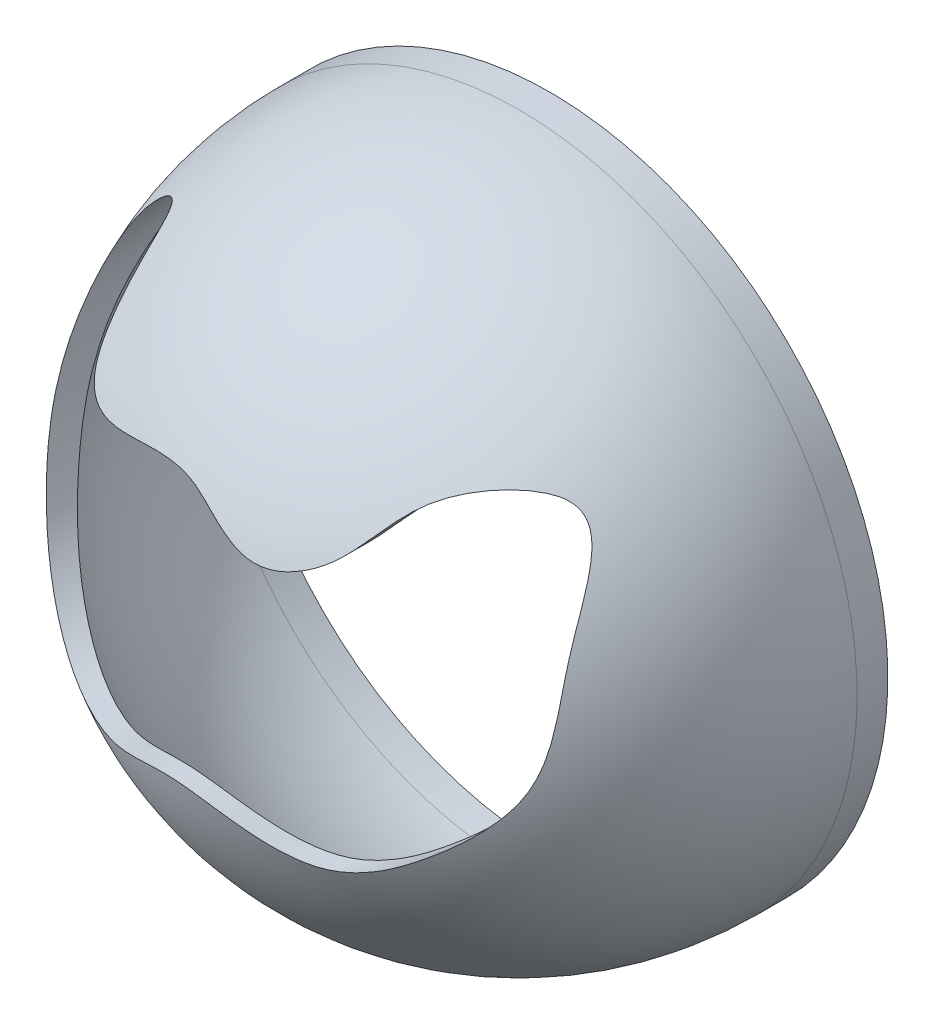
ISO-10303-21;
HEADER;
FILE_DESCRIPTION(('STEP AP214'),'2;1');
FILE_NAME('part.step','',(''),(''),'','','');
FILE_SCHEMA(('AUTOMOTIVE_DESIGN { 1 0 10303 214 1 1 1 1 }'));
ENDSEC;
DATA;
#1=APPLICATION_CONTEXT('core data for automotive mechanical design processes');
#2=APPLICATION_PROTOCOL_DEFINITION('international standard','automotive_design',2000,#1);
#3=PRODUCT_CONTEXT('',#1,'mechanical');
#4=PRODUCT('Part','Part','',(#3));
#5=PRODUCT_RELATED_PRODUCT_CATEGORY('part','',(#4));
#6=PRODUCT_DEFINITION_FORMATION('','',#4);
#7=PRODUCT_DEFINITION_CONTEXT('part definition',#1,'design');
#8=PRODUCT_DEFINITION('design','',#6,#7);
#9=PRODUCT_DEFINITION_SHAPE('','',#8);
#10=(LENGTH_UNIT() NAMED_UNIT(*) SI_UNIT(.MILLI.,.METRE.));
#11=(NAMED_UNIT(*) PLANE_ANGLE_UNIT() SI_UNIT($,.RADIAN.));
#12=(NAMED_UNIT(*) SI_UNIT($,.STERADIAN.) SOLID_ANGLE_UNIT());
#13=UNCERTAINTY_MEASURE_WITH_UNIT(LENGTH_MEASURE(1.E-05),#10,'distance_accuracy_value','');
#14=(GEOMETRIC_REPRESENTATION_CONTEXT(3) GLOBAL_UNCERTAINTY_ASSIGNED_CONTEXT((#13)) GLOBAL_UNIT_ASSIGNED_CONTEXT((#10,
#11,#12)) REPRESENTATION_CONTEXT('',''));
#15=CARTESIAN_POINT('',(0.,0.,0.));
#16=DIRECTION('',(0.,0.,1.));
#17=DIRECTION('',(1.,0.,0.));
#18=AXIS2_PLACEMENT_3D('',#15,#16,#17);
#19=CARTESIAN_POINT('',(0.,0.,-142.580335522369));
#20=DIRECTION('',(0.,0.,-1.));
#21=DIRECTION('',(0.,1.,0.));
#22=AXIS2_PLACEMENT_3D('',#19,#20,#21);
#23=SPHERICAL_SURFACE('',#22,55.);
#24=CARTESIAN_POINT('',(0.,0.,-142.580335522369));
#25=DIRECTION('',(0.,0.,-1.));
#26=DIRECTION('',(-1.,0.,0.));
#27=AXIS2_PLACEMENT_3D('',#24,#25,#26);
#28=CIRCLE('',#27,55.);
#29=CARTESIAN_POINT('',(-55.,0.,-142.580335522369));
#30=VERTEX_POINT('',#29);
#31=EDGE_CURVE('E57',#30,#30,#28,.T.);
#32=ORIENTED_EDGE('',*,*,#31,.F.);
#33=EDGE_LOOP('',(#32));
#34=FACE_BOUND('',#33,.T.);
#35=CARTESIAN_POINT('',(0.,23.1120630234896,-92.6720942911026));
#36=CARTESIAN_POINT('',(0.313971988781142,22.9480757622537,-92.5961532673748));
#37=CARTESIAN_POINT('',(0.627628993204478,22.7820860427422,-92.5232293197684));
#38=CARTESIAN_POINT('',(1.25708558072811,22.4506365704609,-92.385515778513));
#39=CARTESIAN_POINT('',(1.57288546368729,22.2851768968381,-92.3207273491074));
#40=CARTESIAN_POINT('',(2.20954333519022,21.9593103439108,-92.2013895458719));
#41=CARTESIAN_POINT('',(2.53040687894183,21.798909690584,-92.146852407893));
#42=CARTESIAN_POINT('',(3.17465871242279,21.490766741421,-92.0511712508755));
#43=CARTESIAN_POINT('',(3.49795016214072,21.342879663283,-92.0098518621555));
#44=CARTESIAN_POINT('',(4.15276376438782,21.0633143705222,-91.9422163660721));
#45=CARTESIAN_POINT('',(4.48427781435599,20.9316209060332,-91.9158860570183));
#46=CARTESIAN_POINT('',(5.15614649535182,20.6912998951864,-91.8811096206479));
#47=CARTESIAN_POINT('',(5.49648505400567,20.5826333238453,-91.8726330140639));
#48=CARTESIAN_POINT('',(6.02812291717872,20.438335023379,-91.8755635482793));
#49=CARTESIAN_POINT('',(6.21658757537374,20.3919996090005,-91.8796641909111));
#50=CARTESIAN_POINT('',(6.59552980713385,20.3094922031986,-91.8944287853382));
#51=CARTESIAN_POINT('',(6.78600740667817,20.2733203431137,-91.9050928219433));
#52=CARTESIAN_POINT('',(7.07263647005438,20.227515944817,-91.9262653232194));
#53=CARTESIAN_POINT('',(7.16832265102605,20.2136576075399,-91.9341845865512));
#54=CARTESIAN_POINT('',(7.35991278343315,20.188874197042,-91.9517818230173));
#55=CARTESIAN_POINT('',(7.45581673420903,20.1779491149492,-91.9614597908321));
#56=CARTESIAN_POINT('',(7.74400113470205,20.1494595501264,-91.9931091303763));
#57=CARTESIAN_POINT('',(7.93644514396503,20.136229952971,-92.0176730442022));
#58=CARTESIAN_POINT('',(8.32089081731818,20.1207360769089,-92.0733402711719));
#59=CARTESIAN_POINT('',(8.51289221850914,20.1184771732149,-92.104446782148));
#60=CARTESIAN_POINT('',(8.89565358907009,20.1242988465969,-92.1728187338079));
#61=CARTESIAN_POINT('',(9.08641339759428,20.1323807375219,-92.2100849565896));
#62=CARTESIAN_POINT('',(9.46377990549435,20.1580759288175,-92.2899213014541));
#63=CARTESIAN_POINT('',(9.650409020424,20.1755748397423,-92.3324231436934));
#64=CARTESIAN_POINT('',(10.0212776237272,20.2193972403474,-92.4227153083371));
#65=CARTESIAN_POINT('',(10.2055176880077,20.2457185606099,-92.4705043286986));
#66=CARTESIAN_POINT('',(10.5712429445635,20.3065841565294,-92.571052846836));
#67=CARTESIAN_POINT('',(10.752728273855,20.3411280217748,-92.6238120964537));
#68=CARTESIAN_POINT('',(11.1131784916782,20.4179905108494,-92.7341717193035));
#69=CARTESIAN_POINT('',(11.2921339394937,20.4603326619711,-92.7917864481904));
#70=CARTESIAN_POINT('',(11.6466938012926,20.5521921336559,-92.9114414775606));
#71=CARTESIAN_POINT('',(11.8222981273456,20.601709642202,-92.9734818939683));
#72=CARTESIAN_POINT('',(12.1699222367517,20.707428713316,-93.1017288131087));
#73=CARTESIAN_POINT('',(12.3419419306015,20.7636304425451,-93.1679354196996));
#74=CARTESIAN_POINT('',(12.8859013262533,20.9532828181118,-93.3858994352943));
#75=CARTESIAN_POINT('',(13.2507304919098,21.0986893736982,-93.5452192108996));
#76=CARTESIAN_POINT('',(13.9609843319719,21.4156505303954,-93.8808444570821));
#77=CARTESIAN_POINT('',(14.3063921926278,21.5872273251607,-94.0571642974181));
#78=CARTESIAN_POINT('',(14.8083276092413,21.8614294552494,-94.3326828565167));
#79=CARTESIAN_POINT('',(14.9727336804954,21.9554989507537,-94.4262293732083));
#80=CARTESIAN_POINT('',(15.2962470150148,22.1489981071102,-94.6168982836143));
#81=CARTESIAN_POINT('',(15.4553542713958,22.2484277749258,-94.7140206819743));
#82=CARTESIAN_POINT('',(15.767869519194,22.4521718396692,-94.9114909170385));
#83=CARTESIAN_POINT('',(15.9212864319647,22.5564779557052,-95.0118332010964));
#84=CARTESIAN_POINT('',(16.2225769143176,22.7698696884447,-95.2157337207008));
#85=CARTESIAN_POINT('',(16.3704501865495,22.8789555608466,-95.3192921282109));
#86=CARTESIAN_POINT('',(16.6323300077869,23.080036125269,-95.5090448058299));
#87=CARTESIAN_POINT('',(16.7473363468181,23.1712355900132,-95.5947053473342));
#88=CARTESIAN_POINT('',(16.9735832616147,23.3564675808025,-95.7679251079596));
#89=CARTESIAN_POINT('',(17.0848237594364,23.4505001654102,-95.8554843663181));
#90=CARTESIAN_POINT('',(17.3034393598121,23.6413268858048,-96.0324297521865));
#91=CARTESIAN_POINT('',(17.4108141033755,23.7381212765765,-96.121816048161));
#92=CARTESIAN_POINT('',(17.6216991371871,23.9342709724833,-96.3023140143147));
#93=CARTESIAN_POINT('',(17.7252094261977,24.0336262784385,-96.3934256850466));
#94=CARTESIAN_POINT('',(17.9290526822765,24.2347692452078,-96.5775735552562));
#95=CARTESIAN_POINT('',(18.0293735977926,24.336564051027,-96.6706152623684));
#96=CARTESIAN_POINT('',(18.2267846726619,24.5418539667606,-96.8582314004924));
#97=CARTESIAN_POINT('',(18.3238748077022,24.6453490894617,-96.9528058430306));
#98=CARTESIAN_POINT('',(18.6108250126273,24.9578006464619,-97.2387245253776));
#99=CARTESIAN_POINT('',(18.7963633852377,25.1687217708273,-97.4322627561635));
#100=CARTESIAN_POINT('',(19.1594102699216,25.593768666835,-97.8255228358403));
#101=CARTESIAN_POINT('',(19.3368845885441,25.8079037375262,-98.0252658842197));
#102=CARTESIAN_POINT('',(19.6858627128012,26.2360539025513,-98.4299844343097));
#103=CARTESIAN_POINT('',(19.8573667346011,26.4500690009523,-98.6349597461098));
#104=CARTESIAN_POINT('',(20.1974410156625,26.8761060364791,-99.0503923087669));
#105=CARTESIAN_POINT('',(20.3660052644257,27.0881235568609,-99.2608589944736));
#106=CARTESIAN_POINT('',(20.7024517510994,27.5076381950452,-99.6867930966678));
#107=CARTESIAN_POINT('',(20.8703339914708,27.7151353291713,-99.9022604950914));
#108=CARTESIAN_POINT('',(21.2071527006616,28.1227730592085,-100.337193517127));
#109=CARTESIAN_POINT('',(21.3760825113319,28.3229391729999,-100.556640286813));
#110=CARTESIAN_POINT('',(21.7177832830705,28.7147600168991,-101.000085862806));
#111=CARTESIAN_POINT('',(21.8905539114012,28.9064154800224,-101.224084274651));
#112=CARTESIAN_POINT('',(22.2414119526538,29.2787876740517,-101.675710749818));
#113=CARTESIAN_POINT('',(22.4194849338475,29.4595306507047,-101.903328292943));
#114=CARTESIAN_POINT('',(22.7829364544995,29.8086404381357,-102.36219458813));
#115=CARTESIAN_POINT('',(22.9683140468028,29.9770088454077,-102.593442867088));
#116=CARTESIAN_POINT('',(23.2742670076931,30.2371797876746,-102.968908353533));
#117=CARTESIAN_POINT('',(23.3921944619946,30.3334225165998,-103.112216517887));
#118=CARTESIAN_POINT('',(23.6314459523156,30.5201515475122,-103.399743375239));
#119=CARTESIAN_POINT('',(23.7527698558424,30.6106380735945,-103.543962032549));
#120=CARTESIAN_POINT('',(23.9991180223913,30.7856297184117,-103.833320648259));
#121=CARTESIAN_POINT('',(24.1241475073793,30.8701257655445,-103.97846165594));
#122=CARTESIAN_POINT('',(24.3778375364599,31.0326092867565,-104.269214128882));
#123=CARTESIAN_POINT('',(24.5064980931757,31.1105967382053,-104.414825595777));
#124=CARTESIAN_POINT('',(24.7671171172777,31.2602534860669,-104.706461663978));
#125=CARTESIAN_POINT('',(24.8990769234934,31.3319201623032,-104.852486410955));
#126=CARTESIAN_POINT('',(25.165791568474,31.4691839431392,-105.144827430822));
#127=CARTESIAN_POINT('',(25.3005464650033,31.5347809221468,-105.29114370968));
#128=CARTESIAN_POINT('',(25.7099109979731,31.7234843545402,-105.732020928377));
#129=CARTESIAN_POINT('',(25.9882365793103,31.8377180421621,-106.026969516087));
#130=CARTESIAN_POINT('',(26.5522038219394,32.0441174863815,-106.617405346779));
#131=CARTESIAN_POINT('',(26.8378444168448,32.1362864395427,-106.912892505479));
#132=CARTESIAN_POINT('',(27.4147102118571,32.2996886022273,-107.504118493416));
#133=CARTESIAN_POINT('',(27.7059347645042,32.3709242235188,-107.79985728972));
#134=CARTESIAN_POINT('',(28.2899741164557,32.4925671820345,-108.388459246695));
#135=CARTESIAN_POINT('',(28.5827488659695,32.5431622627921,-108.681323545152));
#136=CARTESIAN_POINT('',(29.1716752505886,32.6246553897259,-109.266387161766));
#137=CARTESIAN_POINT('',(29.4678268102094,32.6555538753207,-109.558586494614));
#138=CARTESIAN_POINT('',(30.0631963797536,32.6973281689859,-110.141729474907));
#139=CARTESIAN_POINT('',(30.362416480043,32.7081892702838,-110.432672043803));
#140=CARTESIAN_POINT('',(30.9627150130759,32.7088455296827,-111.011126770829));
#141=CARTESIAN_POINT('',(31.2637863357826,32.6986969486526,-111.298646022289));
#142=CARTESIAN_POINT('',(31.7173360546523,32.6662996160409,-111.726376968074));
#143=CARTESIAN_POINT('',(31.8688124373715,32.652642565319,-111.868334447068));
#144=CARTESIAN_POINT('',(32.1724890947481,32.6192280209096,-112.150741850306));
#145=CARTESIAN_POINT('',(32.3246893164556,32.5994709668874,-112.291191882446));
#146=CARTESIAN_POINT('',(32.6297057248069,32.553413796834,-112.569991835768));
#147=CARTESIAN_POINT('',(32.7825210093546,32.5271211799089,-112.70834397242));
#148=CARTESIAN_POINT('',(33.0890026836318,32.4673704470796,-112.982516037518));
#149=CARTESIAN_POINT('',(33.2426689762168,32.4339131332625,-113.118336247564));
#150=CARTESIAN_POINT('',(33.568315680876,32.3548206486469,-113.401795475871));
#151=CARTESIAN_POINT('',(33.7404097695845,32.308238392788,-113.549043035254));
#152=CARTESIAN_POINT('',(34.0859510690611,32.2037466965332,-113.838030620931));
#153=CARTESIAN_POINT('',(34.2593986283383,32.1458342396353,-113.979769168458));
#154=CARTESIAN_POINT('',(34.5201958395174,32.0491100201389,-114.186253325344));
#155=CARTESIAN_POINT('',(34.6070775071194,32.0152948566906,-114.253945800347));
#156=CARTESIAN_POINT('',(34.7811467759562,31.9440404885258,-114.38701405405));
#157=CARTESIAN_POINT('',(34.8683343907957,31.9066011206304,-114.452389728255));
#158=CARTESIAN_POINT('',(35.0429044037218,31.8277784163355,-114.580324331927));
#159=CARTESIAN_POINT('',(35.1302866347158,31.7863977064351,-114.642885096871));
#160=CARTESIAN_POINT('',(35.3052013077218,31.6992496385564,-114.764628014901));
#161=CARTESIAN_POINT('',(35.3927337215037,31.6534830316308,-114.823810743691));
#162=CARTESIAN_POINT('',(35.5879339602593,31.5461508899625,-114.951376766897));
#163=CARTESIAN_POINT('',(35.6956045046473,31.4833721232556,-115.018747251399));
#164=CARTESIAN_POINT('',(35.910476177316,31.3502826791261,-115.146460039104));
#165=CARTESIAN_POINT('',(36.0176773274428,31.2799723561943,-115.206802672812));
#166=CARTESIAN_POINT('',(36.2308730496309,31.1316444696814,-115.319290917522));
#167=CARTESIAN_POINT('',(36.3368688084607,31.0536353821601,-115.371445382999));
#168=CARTESIAN_POINT('',(36.5469798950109,30.8898475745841,-115.466582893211));
#169=CARTESIAN_POINT('',(36.6510952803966,30.8040690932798,-115.509566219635));
#170=CARTESIAN_POINT('',(36.8573105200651,30.6243802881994,-115.585775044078));
#171=CARTESIAN_POINT('',(36.959389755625,30.5304144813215,-115.618925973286));
#172=CARTESIAN_POINT('',(37.1597851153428,30.3355513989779,-115.674481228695));
#173=CARTESIAN_POINT('',(37.258101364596,30.2346543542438,-115.696885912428));
#174=CARTESIAN_POINT('',(37.4501963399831,30.0267802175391,-115.730836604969));
#175=CARTESIAN_POINT('',(37.5439721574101,29.91979932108,-115.742375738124));
#176=CARTESIAN_POINT('',(37.7262961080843,29.7008890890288,-115.75489782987));
#177=CARTESIAN_POINT('',(37.814843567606,29.5889591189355,-115.755879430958));
#178=CARTESIAN_POINT('',(38.003203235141,29.3388531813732,-115.747196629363));
#179=CARTESIAN_POINT('',(38.1018081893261,29.1998430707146,-115.735401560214));
#180=CARTESIAN_POINT('',(38.2908830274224,28.9179486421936,-115.699307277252));
#181=CARTESIAN_POINT('',(38.3813488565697,28.7750624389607,-115.675001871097));
#182=CARTESIAN_POINT('',(38.5544937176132,28.4866095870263,-115.615667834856));
#183=CARTESIAN_POINT('',(38.6371623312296,28.3410396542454,-115.580625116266));
#184=CARTESIAN_POINT('',(38.7950933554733,28.048383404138,-115.501596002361));
#185=CARTESIAN_POINT('',(38.8703562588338,27.9012971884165,-115.457610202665));
#186=CARTESIAN_POINT('',(39.0300692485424,27.5735200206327,-115.351705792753));
#187=CARTESIAN_POINT('',(39.1128557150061,27.3926098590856,-115.287973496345));
#188=CARTESIAN_POINT('',(39.2695595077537,27.030138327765,-115.151938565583));
#189=CARTESIAN_POINT('',(39.3434731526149,26.8485767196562,-115.079632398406));
#190=CARTESIAN_POINT('',(39.4836286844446,26.4849275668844,-114.928293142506));
#191=CARTESIAN_POINT('',(39.5498575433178,26.3028396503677,-114.849249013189));
#192=CARTESIAN_POINT('',(39.6754782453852,25.9386258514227,-114.686108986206));
#193=CARTESIAN_POINT('',(39.7348710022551,25.7564999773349,-114.602013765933));
#194=CARTESIAN_POINT('',(39.8481112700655,25.3908238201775,-114.42934048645));
#195=CARTESIAN_POINT('',(39.9019128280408,25.2072733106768,-114.340733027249));
#196=CARTESIAN_POINT('',(40.0041871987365,24.8401020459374,-114.160645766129));
#197=CARTESIAN_POINT('',(40.0526598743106,24.6564812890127,-114.069165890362));
#198=CARTESIAN_POINT('',(40.1448651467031,24.289250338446,-113.884229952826));
#199=CARTESIAN_POINT('',(40.1886015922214,24.1056402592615,-113.790775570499));
#200=CARTESIAN_POINT('',(40.2719152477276,23.7381808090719,-113.602482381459));
#201=CARTESIAN_POINT('',(40.3114922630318,23.5543314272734,-113.507643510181));
#202=CARTESIAN_POINT('',(40.3924383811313,23.1595082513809,-113.303274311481));
#203=CARTESIAN_POINT('',(40.4332293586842,22.9484827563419,-113.193615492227));
#204=CARTESIAN_POINT('',(40.5105437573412,22.5258479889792,-112.973913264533));
#205=CARTESIAN_POINT('',(40.5470670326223,22.3142386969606,-112.863869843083));
#206=CARTESIAN_POINT('',(40.6510609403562,21.6780348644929,-112.53391772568));
#207=CARTESIAN_POINT('',(40.712899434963,21.2523451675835,-112.314334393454));
#208=CARTESIAN_POINT('',(40.8249570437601,20.3968552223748,-111.879771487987));
#209=CARTESIAN_POINT('',(40.8751702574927,19.9670530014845,-111.664794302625));
#210=CARTESIAN_POINT('',(40.9666730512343,19.1026642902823,-111.242604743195));
#211=CARTESIAN_POINT('',(41.0079619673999,18.6680774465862,-111.035392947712));
#212=CARTESIAN_POINT('',(41.0840216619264,17.7936040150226,-110.631561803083));
#213=CARTESIAN_POINT('',(41.1187944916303,17.3537191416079,-110.434939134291));
#214=CARTESIAN_POINT('',(41.184189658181,16.4681518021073,-110.055028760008));
#215=CARTESIAN_POINT('',(41.2148140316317,16.0224722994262,-109.871734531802));
#216=CARTESIAN_POINT('',(41.2743123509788,15.1245185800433,-109.521094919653));
#217=CARTESIAN_POINT('',(41.3031854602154,14.6722413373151,-109.353757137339));
#218=CARTESIAN_POINT('',(41.3574992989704,13.762294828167,-109.033503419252));
#219=CARTESIAN_POINT('',(41.3829391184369,13.3046241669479,-108.880591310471));
#220=CARTESIAN_POINT('',(41.4286213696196,12.3848128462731,-108.5874045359));
#221=CARTESIAN_POINT('',(41.4488617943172,11.9226705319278,-108.447134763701));
#222=CARTESIAN_POINT('',(41.4821303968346,10.9949238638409,-108.177163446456));
#223=CARTESIAN_POINT('',(41.4951566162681,10.5293186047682,-108.047464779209));
#224=CARTESIAN_POINT('',(41.5117674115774,9.59572245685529,-107.79630150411));
#225=CARTESIAN_POINT('',(41.5153519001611,9.12773154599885,-107.674836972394));
#226=CARTESIAN_POINT('',(41.5106293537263,8.19050476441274,-107.437528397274));
#227=CARTESIAN_POINT('',(41.5023255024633,7.72126926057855,-107.321682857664));
#228=CARTESIAN_POINT('',(41.4749785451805,6.89766278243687,-107.120759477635));
#229=CARTESIAN_POINT('',(41.4590667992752,6.54332988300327,-107.035100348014));
#230=CARTESIAN_POINT('',(41.4177302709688,5.8352925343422,-106.864036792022));
#231=CARTESIAN_POINT('',(41.3923092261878,5.48158789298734,-106.778632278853));
#232=CARTESIAN_POINT('',(41.3306961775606,4.77544863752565,-106.606711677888));
#233=CARTESIAN_POINT('',(41.2945062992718,4.42301378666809,-106.520195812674));
#234=CARTESIAN_POINT('',(41.2100598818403,3.72006521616,-106.344646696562));
#235=CARTESIAN_POINT('',(41.1617989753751,3.3695522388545,-106.255612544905));
#236=CARTESIAN_POINT('',(41.0526966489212,2.67622704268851,-106.07494600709));
#237=CARTESIAN_POINT('',(40.9920308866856,2.33337438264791,-105.983363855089));
#238=CARTESIAN_POINT('',(40.8566107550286,1.65172084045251,-105.79530069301));
#239=CARTESIAN_POINT('',(40.7818536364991,1.31292076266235,-105.698818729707));
#240=CARTESIAN_POINT('',(40.6173221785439,0.640849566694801,-105.499990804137));
#241=CARTESIAN_POINT('',(40.527553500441,0.307576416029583,-105.39764706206));
#242=CARTESIAN_POINT('',(40.332276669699,-0.352051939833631,-105.186312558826));
#243=CARTESIAN_POINT('',(40.2267743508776,-0.678409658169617,-105.077324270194));
#244=CARTESIAN_POINT('',(39.9975658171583,-1.32851346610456,-104.850192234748));
#245=CARTESIAN_POINT('',(39.8735759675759,-1.6521164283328,-104.731922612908));
#246=CARTESIAN_POINT('',(39.6748978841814,-2.13007546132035,-104.54878562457));
#247=CARTESIAN_POINT('',(39.6065394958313,-2.28818897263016,-104.486769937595));
#248=CARTESIAN_POINT('',(39.4656099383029,-2.60176504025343,-104.360838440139));
#249=CARTESIAN_POINT('',(39.3930387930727,-2.75722761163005,-104.29692264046));
#250=CARTESIAN_POINT('',(39.2437114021,-3.06537768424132,-104.167211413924));
#251=CARTESIAN_POINT('',(39.1669542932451,-3.21806460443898,-104.101415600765));
#252=CARTESIAN_POINT('',(39.0093141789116,-3.52047771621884,-103.967990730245));
#253=CARTESIAN_POINT('',(38.9284311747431,-3.67020390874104,-103.900361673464));
#254=CARTESIAN_POINT('',(38.7627712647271,-3.96671893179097,-103.76350638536));
#255=CARTESIAN_POINT('',(38.6779947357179,-4.1135080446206,-103.694280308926));
#256=CARTESIAN_POINT('',(38.5047818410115,-4.40424927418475,-103.554473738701));
#257=CARTESIAN_POINT('',(38.4163454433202,-4.54820136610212,-103.483893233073));
#258=CARTESIAN_POINT('',(38.143503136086,-4.97968271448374,-103.268587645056));
#259=CARTESIAN_POINT('',(37.9537400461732,-5.26296474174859,-103.122099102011));
#260=CARTESIAN_POINT('',(37.561692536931,-5.8190799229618,-102.826150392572));
#261=CARTESIAN_POINT('',(37.3594074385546,-6.0919125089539,-102.676690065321));
#262=CARTESIAN_POINT('',(36.9436095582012,-6.6280833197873,-102.376157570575));
#263=CARTESIAN_POINT('',(36.7300937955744,-6.89141899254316,-102.225084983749));
#264=CARTESIAN_POINT('',(36.2930462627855,-7.40936242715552,-101.922570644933));
#265=CARTESIAN_POINT('',(36.0695150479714,-7.66397067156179,-101.771128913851));
#266=CARTESIAN_POINT('',(35.5362995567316,-8.25005081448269,-101.417797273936));
#267=CARTESIAN_POINT('',(35.2230327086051,-8.57841507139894,-101.216157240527));
#268=CARTESIAN_POINT('',(34.5822788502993,-9.22283234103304,-100.816094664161));
#269=CARTESIAN_POINT('',(34.2547938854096,-9.53888711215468,-100.617671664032));
#270=CARTESIAN_POINT('',(33.5870183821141,-10.160526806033,-100.225613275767));
#271=CARTESIAN_POINT('',(33.2467231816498,-10.4661078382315,-100.031979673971));
#272=CARTESIAN_POINT('',(32.5546024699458,-11.0683446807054,-99.650899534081));
#273=CARTESIAN_POINT('',(32.2027709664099,-11.3649956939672,-99.4634563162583));
#274=CARTESIAN_POINT('',(31.4887531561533,-11.9507201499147,-99.0960187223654));
#275=CARTESIAN_POINT('',(31.1265621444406,-12.2397900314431,-98.9160278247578));
#276=CARTESIAN_POINT('',(30.3929196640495,-12.8115320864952,-98.5646305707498));
#277=CARTESIAN_POINT('',(30.0214659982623,-13.0942027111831,-98.393226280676));
#278=CARTESIAN_POINT('',(29.4582002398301,-13.5142646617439,-98.1434041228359));
#279=CARTESIAN_POINT('',(29.2694481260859,-13.6536155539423,-98.0613512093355));
#280=CARTESIAN_POINT('',(28.889813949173,-13.9307274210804,-97.8995201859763));
#281=CARTESIAN_POINT('',(28.6989318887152,-14.0684883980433,-97.8197420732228));
#282=CARTESIAN_POINT('',(28.123103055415,-14.4787182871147,-97.583617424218));
#283=CARTESIAN_POINT('',(27.7347831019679,-14.7482770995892,-97.4303963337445));
#284=CARTESIAN_POINT('',(26.9485045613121,-15.2764453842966,-97.130859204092));
#285=CARTESIAN_POINT('',(26.5505517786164,-15.535061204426,-96.9845391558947));
#286=CARTESIAN_POINT('',(25.7440198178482,-16.037972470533,-96.6970559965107));
#287=CARTESIAN_POINT('',(25.3354436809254,-16.282271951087,-96.5558914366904));
#288=CARTESIAN_POINT('',(24.4352382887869,-16.7931949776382,-96.2527356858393));
#289=CARTESIAN_POINT('',(23.9414412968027,-17.0563986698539,-96.0913530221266));
#290=CARTESIAN_POINT('',(22.9370966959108,-17.5499138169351,-95.7697691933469));
#291=CARTESIAN_POINT('',(22.4265475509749,-17.7802222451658,-95.6095681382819));
#292=CARTESIAN_POINT('',(21.3948318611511,-18.1959966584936,-95.2887115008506));
#293=CARTESIAN_POINT('',(20.8738621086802,-18.381960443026,-95.1280836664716));
#294=CARTESIAN_POINT('',(20.081938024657,-18.6217718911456,-94.8830797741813));
#295=CARTESIAN_POINT('',(19.8162223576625,-18.6951858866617,-94.8007360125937));
#296=CARTESIAN_POINT('',(19.2817692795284,-18.8275684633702,-94.6343378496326));
#297=CARTESIAN_POINT('',(19.0130325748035,-18.8865403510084,-94.5502838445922));
#298=CARTESIAN_POINT('',(18.5247667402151,-18.978902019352,-94.3964333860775));
#299=CARTESIAN_POINT('',(18.3056451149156,-19.0150267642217,-94.3269809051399));
#300=CARTESIAN_POINT('',(17.8662972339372,-19.0762213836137,-94.1866653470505));
#301=CARTESIAN_POINT('',(17.6460709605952,-19.1012910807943,-94.115802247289));
#302=CARTESIAN_POINT('',(17.2051141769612,-19.1397437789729,-93.9726371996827));
#303=CARTESIAN_POINT('',(16.9843838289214,-19.1531301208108,-93.9003356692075));
#304=CARTESIAN_POINT('',(16.6533947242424,-19.1640226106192,-93.7908058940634));
#305=CARTESIAN_POINT('',(16.54309260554,-19.1661224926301,-93.7541197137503));
#306=CARTESIAN_POINT('',(16.3225832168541,-19.1672767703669,-93.6804143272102));
#307=CARTESIAN_POINT('',(16.212375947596,-19.1663311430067,-93.6433951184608));
#308=CARTESIAN_POINT('',(15.8799188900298,-19.1590941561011,-93.5312544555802));
#309=CARTESIAN_POINT('',(15.6578903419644,-19.1483386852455,-93.4557320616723));
#310=CARTESIAN_POINT('',(15.2147389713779,-19.1160514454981,-93.3041401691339));
#311=CARTESIAN_POINT('',(14.9936165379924,-19.0945154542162,-93.2280704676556));
#312=CARTESIAN_POINT('',(14.5525116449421,-19.0417557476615,-93.0758803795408));
#313=CARTESIAN_POINT('',(14.3325294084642,-19.0105302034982,-92.9997599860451));
#314=CARTESIAN_POINT('',(13.8939679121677,-18.9394774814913,-92.8479624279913));
#315=CARTESIAN_POINT('',(13.6753879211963,-18.8996552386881,-92.7722850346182));
#316=CARTESIAN_POINT('',(13.0625198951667,-18.777005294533,-92.5605852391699));
#317=CARTESIAN_POINT('',(12.6696522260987,-18.6855108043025,-92.4254517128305));
#318=CARTESIAN_POINT('',(11.8873603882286,-18.4831452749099,-92.1596550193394));
#319=CARTESIAN_POINT('',(11.4979375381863,-18.372267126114,-92.0289935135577));
#320=CARTESIAN_POINT('',(10.7207654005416,-18.1358188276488,-91.7734568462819));
#321=CARTESIAN_POINT('',(10.3330210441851,-18.0102196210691,-91.6485938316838));
#322=CARTESIAN_POINT('',(9.5587128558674,-17.7489419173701,-91.4062434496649));
#323=CARTESIAN_POINT('',(9.17214889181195,-17.613264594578,-91.2887552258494));
#324=CARTESIAN_POINT('',(8.39708786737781,-17.3353045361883,-91.0618023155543));
#325=CARTESIAN_POINT('',(8.00858948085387,-17.1929965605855,-90.9523732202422));
#326=CARTESIAN_POINT('',(7.22976119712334,-16.9062573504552,-90.7431657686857));
#327=CARTESIAN_POINT('',(6.83943122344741,-16.7618260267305,-90.6433878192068));
#328=CARTESIAN_POINT('',(6.06220396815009,-16.4772970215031,-90.4562023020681));
#329=CARTESIAN_POINT('',(5.67536296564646,-16.3371675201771,-90.3686116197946));
#330=CARTESIAN_POINT('',(5.09175875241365,-16.1313322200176,-90.245850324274));
#331=CARTESIAN_POINT('',(4.89666918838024,-16.0634477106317,-90.2063677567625));
#332=CARTESIAN_POINT('',(4.50521974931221,-15.92968088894,-90.1304309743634));
#333=CARTESIAN_POINT('',(4.30885987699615,-15.863798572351,-90.0939767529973));
#334=CARTESIAN_POINT('',(3.71920009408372,-15.6702706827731,-89.9895974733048));
#335=CARTESIAN_POINT('',(3.32386223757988,-15.546222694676,-89.9263469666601));
#336=CARTESIAN_POINT('',(2.52727676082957,-15.3112375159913,-89.8133521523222));
#337=CARTESIAN_POINT('',(2.12602810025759,-15.200302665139,-89.7636102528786));
#338=CARTESIAN_POINT('',(1.31913487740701,-14.99597566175,-89.6789657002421));
#339=CARTESIAN_POINT('',(0.91351306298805,-14.9025178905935,-89.6440068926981));
#340=CARTESIAN_POINT('',(0.0969491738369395,-14.7371386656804,-89.5899454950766));
#341=CARTESIAN_POINT('',(-0.313989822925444,-14.6652052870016,-89.5708341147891));
#342=CARTESIAN_POINT('',(-0.959321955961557,-14.5734398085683,-89.5544014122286));
#343=CARTESIAN_POINT('',(-1.19230360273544,-14.5445815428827,-89.5512051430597));
#344=CARTESIAN_POINT('',(-1.65938347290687,-14.4961059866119,-89.5504900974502));
#345=CARTESIAN_POINT('',(-1.89348224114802,-14.4764938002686,-89.5529744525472));
#346=CARTESIAN_POINT('',(-2.36214671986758,-14.4474408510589,-89.5638583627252));
#347=CARTESIAN_POINT('',(-2.59671231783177,-14.4379978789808,-89.5722566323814));
#348=CARTESIAN_POINT('',(-2.94840814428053,-14.4320817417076,-89.5894336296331));
#349=CARTESIAN_POINT('',(-3.06559386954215,-14.4314837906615,-89.5959210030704));
#350=CARTESIAN_POINT('',(-3.29984839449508,-14.4331516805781,-89.6104487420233));
#351=CARTESIAN_POINT('',(-3.41691719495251,-14.4354175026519,-89.6184890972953));
#352=CARTESIAN_POINT('',(-3.7696597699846,-14.4465467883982,-89.6450646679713));
#353=CARTESIAN_POINT('',(-4.00503192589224,-14.4597738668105,-89.6659649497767));
#354=CARTESIAN_POINT('',(-4.47442414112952,-14.496701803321,-89.7136995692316));
#355=CARTESIAN_POINT('',(-4.7084435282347,-14.5204074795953,-89.740536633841));
#356=CARTESIAN_POINT('',(-5.17469520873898,-14.5771776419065,-89.7998044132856));
#357=CARTESIAN_POINT('',(-5.40692692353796,-14.6102450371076,-89.8322368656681));
#358=CARTESIAN_POINT('',(-5.86914571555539,-14.6845507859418,-89.9023220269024));
#359=CARTESIAN_POINT('',(-6.0991338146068,-14.7257852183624,-89.9399722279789));
#360=CARTESIAN_POINT('',(-6.78911680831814,-14.8607016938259,-90.060866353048));
#361=CARTESIAN_POINT('',(-7.24570961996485,-14.9651479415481,-90.1516102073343));
#362=CARTESIAN_POINT('',(-8.14996951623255,-15.1938288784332,-90.3505247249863));
#363=CARTESIAN_POINT('',(-8.59763408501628,-15.3180690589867,-90.4587002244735));
#364=CARTESIAN_POINT('',(-9.48620028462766,-15.5789251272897,-90.6906700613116));
#365=CARTESIAN_POINT('',(-9.92708663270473,-15.7155652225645,-90.8144951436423));
#366=CARTESIAN_POINT('',(-10.8038335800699,-15.9945730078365,-91.0761604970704));
#367=CARTESIAN_POINT('',(-11.2396824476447,-16.136951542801,-91.2140281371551));
#368=CARTESIAN_POINT('',(-12.1079104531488,-16.4213522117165,-91.5022835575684));
#369=CARTESIAN_POINT('',(-12.5402852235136,-16.5633737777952,-91.6526850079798));
#370=CARTESIAN_POINT('',(-13.4028305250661,-16.8413376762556,-91.9644978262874));
#371=CARTESIAN_POINT('',(-13.8330017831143,-16.9772821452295,-92.1259052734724));
#372=CARTESIAN_POINT('',(-14.692520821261,-17.2377424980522,-92.4582941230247));
#373=CARTESIAN_POINT('',(-15.1218689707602,-17.3622718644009,-92.6292638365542));
#374=CARTESIAN_POINT('',(-15.766274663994,-17.5366533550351,-92.8918315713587));
#375=CARTESIAN_POINT('',(-15.9809492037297,-17.5926674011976,-92.9802915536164));
#376=CARTESIAN_POINT('',(-16.4106919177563,-17.699968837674,-93.1591120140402));
#377=CARTESIAN_POINT('',(-16.6257600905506,-17.7512562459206,-93.2494724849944));
#378=CARTESIAN_POINT('',(-17.0560718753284,-17.8483943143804,-93.4317637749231));
#379=CARTESIAN_POINT('',(-17.2713147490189,-17.8942529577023,-93.5236920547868));
#380=CARTESIAN_POINT('',(-17.5945918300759,-17.9585404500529,-93.6626967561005));
#381=CARTESIAN_POINT('',(-17.7024204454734,-17.9792196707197,-93.7092173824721));
#382=CARTESIAN_POINT('',(-17.9182144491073,-18.0190184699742,-93.8026071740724));
#383=CARTESIAN_POINT('',(-18.0261798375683,-18.0381380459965,-93.8494763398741));
#384=CARTESIAN_POINT('',(-18.3501878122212,-18.0931695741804,-93.9905767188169));
#385=CARTESIAN_POINT('',(-18.5664028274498,-18.1267663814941,-94.0853268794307));
#386=CARTESIAN_POINT('',(-18.9991049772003,-18.187826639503,-94.276155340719));
#387=CARTESIAN_POINT('',(-19.2155921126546,-18.2152900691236,-94.3722336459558));
#388=CARTESIAN_POINT('',(-19.7926772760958,-18.2803763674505,-94.6299933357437));
#389=CARTESIAN_POINT('',(-20.1533866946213,-18.3126127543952,-94.7928184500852));
#390=CARTESIAN_POINT('',(-20.8747982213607,-18.3604735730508,-95.1219981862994));
#391=CARTESIAN_POINT('',(-21.2354998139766,-18.3760782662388,-95.2883567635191));
#392=CARTESIAN_POINT('',(-21.9560246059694,-18.390819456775,-95.6243039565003));
#393=CARTESIAN_POINT('',(-22.315847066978,-18.3899450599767,-95.7938946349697));
#394=CARTESIAN_POINT('',(-23.0337361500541,-18.3718855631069,-96.1359708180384));
#395=CARTESIAN_POINT('',(-23.3918026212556,-18.3546990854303,-96.3084565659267));
#396=CARTESIAN_POINT('',(-24.1072338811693,-18.3040550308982,-96.6568931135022));
#397=CARTESIAN_POINT('',(-24.464586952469,-18.2705193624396,-96.8328566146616));
#398=CARTESIAN_POINT('',(-25.1760566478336,-18.1873031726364,-97.1870788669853));
#399=CARTESIAN_POINT('',(-25.5301746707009,-18.1376300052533,-97.3653365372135));
#400=CARTESIAN_POINT('',(-26.2346529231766,-18.0222633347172,-97.7238920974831));
#401=CARTESIAN_POINT('',(-26.585013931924,-17.956573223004,-97.9041895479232));
#402=CARTESIAN_POINT('',(-27.2814613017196,-17.8092568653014,-98.2665481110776));
#403=CARTESIAN_POINT('',(-27.627547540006,-17.7276301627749,-98.4486092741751));
#404=CARTESIAN_POINT('',(-28.3142796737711,-17.5486540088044,-98.8138493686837));
#405=CARTESIAN_POINT('',(-28.6549334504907,-17.4513301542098,-98.9970260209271));
#406=CARTESIAN_POINT('',(-29.3308143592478,-17.2408989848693,-99.3644382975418));
#407=CARTESIAN_POINT('',(-29.6660407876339,-17.127789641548,-99.5486740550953));
#408=CARTESIAN_POINT('',(-30.3304081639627,-16.8858210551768,-99.9177708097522));
#409=CARTESIAN_POINT('',(-30.6595491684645,-16.7569619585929,-100.102631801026));
#410=CARTESIAN_POINT('',(-31.3110997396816,-16.4835276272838,-100.472529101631));
#411=CARTESIAN_POINT('',(-31.6335098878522,-16.3389537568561,-100.657565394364));
#412=CARTESIAN_POINT('',(-32.2705977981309,-16.0342156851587,-101.027103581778));
#413=CARTESIAN_POINT('',(-32.5852841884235,-15.8740699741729,-101.211605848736));
#414=CARTESIAN_POINT('',(-33.2067927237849,-15.5386482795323,-101.580116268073));
#415=CARTESIAN_POINT('',(-33.5136146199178,-15.363371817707,-101.764124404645));
#416=CARTESIAN_POINT('',(-34.1189353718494,-14.9983453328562,-102.131521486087));
#417=CARTESIAN_POINT('',(-34.4174336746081,-14.8085943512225,-102.314910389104));
#418=CARTESIAN_POINT('',(-35.0056453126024,-14.4152305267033,-102.680904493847));
#419=CARTESIAN_POINT('',(-35.2953586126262,-14.2116176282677,-102.863509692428));
#420=CARTESIAN_POINT('',(-35.8649747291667,-13.7915427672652,-103.227382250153));
#421=CARTESIAN_POINT('',(-36.1448971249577,-13.5751090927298,-103.408651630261));
#422=CARTESIAN_POINT('',(-36.6951620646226,-13.1295245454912,-103.770045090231));
#423=CARTESIAN_POINT('',(-36.9655051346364,-12.9003743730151,-103.950169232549));
#424=CARTESIAN_POINT('',(-37.496226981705,-12.4298105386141,-104.309057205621));
#425=CARTESIAN_POINT('',(-37.756605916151,-12.1883970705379,-104.487821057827));
#426=CARTESIAN_POINT('',(-38.2670029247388,-11.6937108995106,-104.843727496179));
#427=CARTESIAN_POINT('',(-38.517020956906,-11.4404381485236,-105.020870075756));
#428=CARTESIAN_POINT('',(-39.0058658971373,-10.9228253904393,-105.372920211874));
#429=CARTESIAN_POINT('',(-39.2447108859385,-10.6585046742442,-105.547831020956));
#430=CARTESIAN_POINT('',(-39.7112126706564,-10.1187028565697,-105.895340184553));
#431=CARTESIAN_POINT('',(-39.9388694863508,-9.84322177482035,-106.067938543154));
#432=CARTESIAN_POINT('',(-40.3825292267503,-9.28133074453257,-106.410379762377));
#433=CARTESIAN_POINT('',(-40.598531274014,-8.99491997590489,-106.580222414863));
#434=CARTESIAN_POINT('',(-41.0183790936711,-8.41132409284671,-106.916632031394));
#435=CARTESIAN_POINT('',(-41.2222218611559,-8.1141363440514,-107.083198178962));
#436=CARTESIAN_POINT('',(-41.6262680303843,-7.49516099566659,-107.420004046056));
#437=CARTESIAN_POINT('',(-41.82586183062,-7.17287204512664,-107.590054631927));
#438=CARTESIAN_POINT('',(-42.2102331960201,-6.51689063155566,-107.924904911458));
#439=CARTESIAN_POINT('',(-42.3950107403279,-6.18319815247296,-108.089704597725));
#440=CARTESIAN_POINT('',(-42.660325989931,-5.67430583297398,-108.3320952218));
#441=CARTESIAN_POINT('',(-42.7467795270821,-5.50330389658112,-108.412081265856));
#442=CARTESIAN_POINT('',(-42.9156278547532,-5.15850812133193,-108.570310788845));
#443=CARTESIAN_POINT('',(-42.9980226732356,-4.98471430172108,-108.64855427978));
#444=CARTESIAN_POINT('',(-43.1585808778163,-4.6343949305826,-108.803089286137));
#445=CARTESIAN_POINT('',(-43.2367454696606,-4.4578701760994,-108.879381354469));
#446=CARTESIAN_POINT('',(-43.3887686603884,-4.10211955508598,-109.029918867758));
#447=CARTESIAN_POINT('',(-43.4626272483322,-3.92289368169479,-109.104164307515));
#448=CARTESIAN_POINT('',(-43.6780485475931,-3.38077978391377,-109.324188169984));
#449=CARTESIAN_POINT('',(-43.8131670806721,-3.01408859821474,-109.466975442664));
#450=CARTESIAN_POINT('',(-44.066543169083,-2.27204645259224,-109.745130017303));
#451=CARTESIAN_POINT('',(-44.1847945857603,-1.89669239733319,-109.880494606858));
#452=CARTESIAN_POINT('',(-44.4049927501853,-1.13885092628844,-110.144663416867));
#453=CARTESIAN_POINT('',(-44.5069349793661,-0.756361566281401,-110.273465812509));
#454=CARTESIAN_POINT('',(-44.69523141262,0.0140716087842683,-110.5255511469));
#455=CARTESIAN_POINT('',(-44.7815901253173,0.402013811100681,-110.648835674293));
#456=CARTESIAN_POINT('',(-44.9620871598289,1.29252330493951,-110.925557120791));
#457=CARTESIAN_POINT('',(-45.0515113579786,1.79646120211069,-111.077654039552));
#458=CARTESIAN_POINT('',(-45.2086181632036,2.80871244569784,-111.378141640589));
#459=CARTESIAN_POINT('',(-45.2763021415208,3.31702551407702,-111.526532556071));
#460=CARTESIAN_POINT('',(-45.3924564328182,4.33619654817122,-111.823100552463));
#461=CARTESIAN_POINT('',(-45.4409155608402,4.84705582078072,-111.971277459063));
#462=CARTESIAN_POINT('',(-45.5211460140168,5.86946521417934,-112.270927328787));
#463=CARTESIAN_POINT('',(-45.5529062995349,6.38101556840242,-112.42240240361));
#464=CARTESIAN_POINT('',(-45.6022693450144,7.4029597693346,-112.732135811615));
#465=CARTESIAN_POINT('',(-45.6198663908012,7.91335306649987,-112.890396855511));
#466=CARTESIAN_POINT('',(-45.6434295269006,8.93115384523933,-113.217133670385));
#467=CARTESIAN_POINT('',(-45.6493955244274,9.43856130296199,-113.38560952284));
#468=CARTESIAN_POINT('',(-45.6515080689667,10.1960339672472,-113.64848276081));
#469=CARTESIAN_POINT('',(-45.6510735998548,10.4478692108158,-113.737781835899));
#470=CARTESIAN_POINT('',(-45.648238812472,10.9501501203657,-113.920190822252));
#471=CARTESIAN_POINT('',(-45.6458384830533,11.2005957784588,-114.013300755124));
#472=CARTESIAN_POINT('',(-45.6393850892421,11.6996961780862,-114.203673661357));
#473=CARTESIAN_POINT('',(-45.6353331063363,11.9483519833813,-114.300933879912));
#474=CARTESIAN_POINT('',(-45.6258807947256,12.4437890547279,-114.500050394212));
#475=CARTESIAN_POINT('',(-45.6204804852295,12.6905703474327,-114.601906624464));
#476=CARTESIAN_POINT('',(-45.6086534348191,13.1818943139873,-114.810574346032));
#477=CARTESIAN_POINT('',(-45.6022270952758,13.4264378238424,-114.917383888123));
#478=CARTESIAN_POINT('',(-45.5885998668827,13.9131259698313,-115.136288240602));
#479=CARTESIAN_POINT('',(-45.5813989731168,14.155270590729,-115.248383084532));
#480=CARTESIAN_POINT('',(-45.5656418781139,14.637370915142,-115.476998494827));
#481=CARTESIAN_POINT('',(-45.5570858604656,14.8773269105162,-115.593518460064));
#482=CARTESIAN_POINT('',(-45.5380905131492,15.3553356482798,-115.830247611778));
#483=CARTESIAN_POINT('',(-45.5276511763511,15.5933883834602,-115.95045681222));
#484=CARTESIAN_POINT('',(-45.5064328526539,16.0254824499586,-116.172069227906));
#485=CARTESIAN_POINT('',(-45.4960477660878,16.2197883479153,-116.272995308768));
#486=CARTESIAN_POINT('',(-45.4733481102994,16.6074628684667,-116.476411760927));
#487=CARTESIAN_POINT('',(-45.4610335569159,16.800831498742,-116.578902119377));
#488=CARTESIAN_POINT('',(-45.4207453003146,17.3798325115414,-116.888127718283));
#489=CARTESIAN_POINT('',(-45.3894290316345,17.7643159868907,-117.096594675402));
#490=CARTESIAN_POINT('',(-45.3154459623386,18.5316674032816,-117.514820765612));
#491=CARTESIAN_POINT('',(-45.2727753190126,18.9145347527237,-117.72458031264));
#492=CARTESIAN_POINT('',(-45.1736358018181,19.6793619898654,-118.141488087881));
#493=CARTESIAN_POINT('',(-45.1171829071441,20.0613224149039,-118.348639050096));
#494=CARTESIAN_POINT('',(-44.9878755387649,20.8258142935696,-118.756642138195));
#495=CARTESIAN_POINT('',(-44.9150237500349,21.2083456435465,-118.957495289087));
#496=CARTESIAN_POINT('',(-44.7503278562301,21.974658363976,-119.348582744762));
#497=CARTESIAN_POINT('',(-44.6584894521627,22.3584393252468,-119.538820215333));
#498=CARTESIAN_POINT('',(-44.4474293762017,23.1495089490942,-119.914493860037));
#499=CARTESIAN_POINT('',(-44.3269481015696,23.5568940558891,-120.099042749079));
#500=CARTESIAN_POINT('',(-44.1263681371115,24.1686334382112,-120.358850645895));
#501=CARTESIAN_POINT('',(-44.0561943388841,24.372667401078,-120.442621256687));
#502=CARTESIAN_POINT('',(-43.9090050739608,24.7807591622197,-120.603830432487));
#503=CARTESIAN_POINT('',(-43.8319903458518,24.9848169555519,-120.681269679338));
#504=CARTESIAN_POINT('',(-43.6712048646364,25.3920791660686,-120.828981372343));
#505=CARTESIAN_POINT('',(-43.5874551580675,25.595284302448,-120.899274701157));
#506=CARTESIAN_POINT('',(-43.4129482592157,26.0010961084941,-121.032432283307));
#507=CARTESIAN_POINT('',(-43.3221918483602,26.2037028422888,-121.09529736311));
#508=CARTESIAN_POINT('',(-43.1336951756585,26.6079576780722,-121.213207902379));
#509=CARTESIAN_POINT('',(-43.0359546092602,26.8096057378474,-121.268253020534));
#510=CARTESIAN_POINT('',(-42.8336416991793,27.211489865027,-121.370263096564));
#511=CARTESIAN_POINT('',(-42.7290698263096,27.4117260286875,-121.417228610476));
#512=CARTESIAN_POINT('',(-42.4773350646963,27.8768455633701,-121.517285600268));
#513=CARTESIAN_POINT('',(-42.327595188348,28.1410272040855,-121.567199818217));
#514=CARTESIAN_POINT('',(-42.0170920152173,28.665215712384,-121.652745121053));
#515=CARTESIAN_POINT('',(-41.8563270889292,28.9252219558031,-121.688374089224));
#516=CARTESIAN_POINT('',(-41.5247136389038,29.440231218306,-121.746095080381));
#517=CARTESIAN_POINT('',(-41.3538652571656,29.6952343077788,-121.768187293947));
#518=CARTESIAN_POINT('',(-41.0019414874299,30.2012888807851,-121.80008529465));
#519=CARTESIAN_POINT('',(-40.8208073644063,30.452304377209,-121.809811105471));
#520=CARTESIAN_POINT('',(-40.4503126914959,30.9483357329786,-121.818144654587));
#521=CARTESIAN_POINT('',(-40.2609522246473,31.1933516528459,-121.816752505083));
#522=CARTESIAN_POINT('',(-39.8750179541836,31.6773661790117,-121.804790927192));
#523=CARTESIAN_POINT('',(-39.67844440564,31.9163649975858,-121.794221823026));
#524=CARTESIAN_POINT('',(-39.3013616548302,32.3613588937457,-121.766380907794));
#525=CARTESIAN_POINT('',(-39.1215668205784,32.5680170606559,-121.750007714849));
#526=CARTESIAN_POINT('',(-38.7569368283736,32.9761679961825,-121.710561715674));
#527=CARTESIAN_POINT('',(-38.5721020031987,33.1776611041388,-121.687489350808));
#528=CARTESIAN_POINT('',(-38.197331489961,33.5751090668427,-121.633944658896));
#529=CARTESIAN_POINT('',(-38.0073924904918,33.7710601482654,-121.603467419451));
#530=CARTESIAN_POINT('',(-37.6236569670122,34.1553412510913,-121.534015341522));
#531=CARTESIAN_POINT('',(-37.4298892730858,34.3437089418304,-121.495090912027));
#532=CARTESIAN_POINT('',(-37.0375753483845,34.7126620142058,-121.406683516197));
#533=CARTESIAN_POINT('',(-36.8390317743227,34.8932515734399,-121.357206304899));
#534=CARTESIAN_POINT('',(-36.4374179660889,35.2446985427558,-121.244918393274));
#535=CARTESIAN_POINT('',(-36.2343532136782,35.4155669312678,-121.182123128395));
#536=CARTESIAN_POINT('',(-35.9195787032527,35.6682090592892,-121.072569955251));
#537=CARTESIAN_POINT('',(-35.8093146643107,35.7544528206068,-121.031940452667));
#538=CARTESIAN_POINT('',(-35.5877940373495,35.9227532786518,-120.945041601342));
#539=CARTESIAN_POINT('',(-35.476537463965,36.0048100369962,-120.898772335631));
#540=CARTESIAN_POINT('',(-35.2532289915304,36.1640471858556,-120.799775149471));
#541=CARTESIAN_POINT('',(-35.1411765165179,36.2412235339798,-120.747041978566));
#542=CARTESIAN_POINT('',(-34.916796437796,36.3897032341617,-120.63430857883));
#543=CARTESIAN_POINT('',(-34.8044688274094,36.4610064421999,-120.574308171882));
#544=CARTESIAN_POINT('',(-34.5785175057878,36.5976340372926,-120.445267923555));
#545=CARTESIAN_POINT('',(-34.4648990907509,36.6628548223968,-120.376107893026));
#546=CARTESIAN_POINT('',(-34.2389843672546,36.784766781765,-120.228718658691));
#547=CARTESIAN_POINT('',(-34.1266876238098,36.8414608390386,-120.150492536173));
#548=CARTESIAN_POINT('',(-33.9048164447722,36.9448183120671,-119.984636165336));
#549=CARTESIAN_POINT('',(-33.7952367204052,36.9915028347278,-119.89702630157));
#550=CARTESIAN_POINT('',(-33.5800169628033,37.0736226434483,-119.712219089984));
#551=CARTESIAN_POINT('',(-33.474375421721,37.1090622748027,-119.615025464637));
#552=CARTESIAN_POINT('',(-33.2927472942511,37.1607473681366,-119.435474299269));
#553=CARTESIAN_POINT('',(-33.2156222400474,37.1795458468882,-119.354992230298));
#554=CARTESIAN_POINT('',(-33.0652270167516,37.209639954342,-119.189178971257));
#555=CARTESIAN_POINT('',(-32.9919562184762,37.2209368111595,-119.103848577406));
#556=CARTESIAN_POINT('',(-32.8498436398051,37.2359188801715,-118.928974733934));
#557=CARTESIAN_POINT('',(-32.7810008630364,37.2396058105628,-118.839432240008));
#558=CARTESIAN_POINT('',(-32.6481381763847,37.2394700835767,-118.656838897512));
#559=CARTESIAN_POINT('',(-32.5841187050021,37.2356467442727,-118.56378773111));
#560=CARTESIAN_POINT('',(-32.4614569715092,37.2207958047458,-118.375402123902));
#561=CARTESIAN_POINT('',(-32.4027908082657,37.2098022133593,-118.280080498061));
#562=CARTESIAN_POINT('',(-32.2905892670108,37.1810533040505,-118.087484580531));
#563=CARTESIAN_POINT('',(-32.2370534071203,37.1632986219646,-117.990210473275));
#564=CARTESIAN_POINT('',(-32.1350539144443,37.1214700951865,-117.794303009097));
#565=CARTESIAN_POINT('',(-32.0865934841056,37.0973922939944,-117.695668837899));
#566=CARTESIAN_POINT('',(-31.9945331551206,37.0435404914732,-117.497699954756));
#567=CARTESIAN_POINT('',(-31.950934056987,37.0137655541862,-117.398365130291));
#568=CARTESIAN_POINT('',(-31.8293050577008,36.9193288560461,-117.106707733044));
#569=CARTESIAN_POINT('',(-31.7571019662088,36.8480356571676,-116.914093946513));
#570=CARTESIAN_POINT('',(-31.62521364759,36.69169883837,-116.530143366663));
#571=CARTESIAN_POINT('',(-31.5655410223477,36.6066415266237,-116.338808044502));
#572=CARTESIAN_POINT('',(-31.4558815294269,36.4253729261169,-115.957648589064));
#573=CARTESIAN_POINT('',(-31.4059373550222,36.32911530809,-115.767834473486));
#574=CARTESIAN_POINT('',(-31.3140513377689,36.1278655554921,-115.391087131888));
#575=CARTESIAN_POINT('',(-31.2721059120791,36.0228773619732,-115.204152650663));
#576=CARTESIAN_POINT('',(-31.2030347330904,35.8291223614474,-114.87340690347));
#577=CARTESIAN_POINT('',(-31.1746666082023,35.7417647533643,-114.729021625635));
#578=CARTESIAN_POINT('',(-31.1212939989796,35.5630882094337,-114.442085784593));
#579=CARTESIAN_POINT('',(-31.0962897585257,35.4717689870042,-114.299535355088));
#580=CARTESIAN_POINT('',(-31.0255108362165,35.1923308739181,-113.874327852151));
#581=CARTESIAN_POINT('',(-30.984032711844,34.9989158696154,-113.594425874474));
#582=CARTESIAN_POINT('',(-30.9093746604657,34.6003452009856,-113.041472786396));
#583=CARTESIAN_POINT('',(-30.8762062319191,34.3951737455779,-112.768431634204));
#584=CARTESIAN_POINT('',(-30.81589616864,33.975094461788,-112.22920319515));
#585=CARTESIAN_POINT('',(-30.7887557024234,33.7601847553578,-111.96301724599));
#586=CARTESIAN_POINT('',(-30.738525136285,33.3213549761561,-111.436333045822));
#587=CARTESIAN_POINT('',(-30.7154485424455,33.0974077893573,-111.175856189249));
#588=CARTESIAN_POINT('',(-30.6718230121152,32.642545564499,-110.661348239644));
#589=CARTESIAN_POINT('',(-30.6512714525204,32.4116380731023,-110.407310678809));
#590=CARTESIAN_POINT('',(-30.6111640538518,31.943732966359,-109.905074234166));
#591=CARTESIAN_POINT('',(-30.5916077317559,31.7067383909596,-109.656872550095));
#592=CARTESIAN_POINT('',(-30.552011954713,31.2275004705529,-109.165729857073));
#593=CARTESIAN_POINT('',(-30.5319725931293,30.9852581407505,-108.922787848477));
#594=CARTESIAN_POINT('',(-30.4936925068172,30.5405855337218,-108.485077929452));
#595=CARTESIAN_POINT('',(-30.4757820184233,30.3388790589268,-108.289544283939));
#596=CARTESIAN_POINT('',(-30.4377102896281,29.9329906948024,-107.901219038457));
#597=CARTESIAN_POINT('',(-30.4175486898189,29.728808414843,-107.708427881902));
#598=CARTESIAN_POINT('',(-30.3739739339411,29.3184862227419,-107.325160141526));
#599=CARTESIAN_POINT('',(-30.3505596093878,29.112345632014,-107.134684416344));
#600=CARTESIAN_POINT('',(-30.2993328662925,28.6986953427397,-106.755557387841));
#601=CARTESIAN_POINT('',(-30.2715177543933,28.4911848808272,-106.56690727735));
#602=CARTESIAN_POINT('',(-30.2102414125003,28.0762048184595,-106.191503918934));
#603=CARTESIAN_POINT('',(-30.1767941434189,27.868736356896,-106.004747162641));
#604=CARTESIAN_POINT('',(-30.1026258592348,27.4543465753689,-105.632131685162));
#605=CARTESIAN_POINT('',(-30.0619062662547,27.2474251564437,-105.44627279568));
#606=CARTESIAN_POINT('',(-29.9712831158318,26.835538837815,-105.074936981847));
#607=CARTESIAN_POINT('',(-29.9213870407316,26.6305724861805,-104.8894598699));
#608=CARTESIAN_POINT('',(-29.8100098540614,26.2242679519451,-104.518151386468));
#609=CARTESIAN_POINT('',(-29.7485350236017,26.0229278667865,-104.332320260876));
#610=CARTESIAN_POINT('',(-29.6234137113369,25.6621551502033,-103.993290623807));
#611=CARTESIAN_POINT('',(-29.5621712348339,25.5017295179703,-103.840269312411));
#612=CARTESIAN_POINT('',(-29.4278349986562,25.1867775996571,-103.533163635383));
#613=CARTESIAN_POINT('',(-29.3547390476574,25.0322524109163,-103.379079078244));
#614=CARTESIAN_POINT('',(-29.2346642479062,24.8072615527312,-103.147515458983));
#615=CARTESIAN_POINT('',(-29.193001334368,24.7335483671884,-103.070420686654));
#616=CARTESIAN_POINT('',(-29.1058534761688,24.5886617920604,-102.915992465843));
#617=CARTESIAN_POINT('',(-29.0603685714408,24.5174883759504,-102.838659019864));
#618=CARTESIAN_POINT('',(-28.965285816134,24.3781789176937,-102.683848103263));
#619=CARTESIAN_POINT('',(-28.9156897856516,24.3100415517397,-102.606370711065));
#620=CARTESIAN_POINT('',(-28.8120762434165,24.1772968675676,-102.451347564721));
#621=CARTESIAN_POINT('',(-28.7580589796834,24.1126893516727,-102.373801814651));
#622=CARTESIAN_POINT('',(-28.6542231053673,23.9968210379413,-102.230645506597));
#623=CARTESIAN_POINT('',(-28.6050206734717,23.9450275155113,-102.165018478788));
#624=CARTESIAN_POINT('',(-28.5035315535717,23.8442924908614,-102.033969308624));
#625=CARTESIAN_POINT('',(-28.4512448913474,23.7953509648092,-101.968547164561));
#626=CARTESIAN_POINT('',(-28.2898520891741,23.6529701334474,-101.772751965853));
#627=CARTESIAN_POINT('',(-28.1762047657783,23.5639652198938,-101.642838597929));
#628=CARTESIAN_POINT('',(-27.937554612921,23.3983064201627,-101.385067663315));
#629=CARTESIAN_POINT('',(-27.8125300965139,23.3216769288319,-101.257214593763));
#630=CARTESIAN_POINT('',(-27.5525212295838,23.1811164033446,-101.004715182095));
#631=CARTESIAN_POINT('',(-27.4175363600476,23.1171860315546,-100.880069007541));
#632=CARTESIAN_POINT('',(-27.1086569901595,22.9892262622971,-100.608057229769));
#633=CARTESIAN_POINT('',(-26.9326810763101,22.928193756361,-100.461640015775));
#634=CARTESIAN_POINT('',(-26.5704118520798,22.8234550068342,-100.175627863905));
#635=CARTESIAN_POINT('',(-26.3841157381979,22.7797534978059,-100.036034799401));
#636=CARTESIAN_POINT('',(-25.8125031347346,22.6722125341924,-99.6279255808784));
#637=CARTESIAN_POINT('',(-25.4147269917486,22.6320391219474,-99.3703084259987));
#638=CARTESIAN_POINT('',(-24.8382351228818,22.6100370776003,-99.027063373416));
#639=CARTESIAN_POINT('',(-24.6670633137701,22.6078452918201,-98.9287565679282));
#640=CARTESIAN_POINT('',(-24.3219798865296,22.6110467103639,-98.7371977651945));
#641=CARTESIAN_POINT('',(-24.1480688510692,22.6164383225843,-98.6439447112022));
#642=CARTESIAN_POINT('',(-23.6228111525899,22.6426675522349,-98.3714178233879));
#643=CARTESIAN_POINT('',(-23.2681425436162,22.6735650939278,-98.1994957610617));
#644=CARTESIAN_POINT('',(-22.5522647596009,22.7560736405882,-97.8733635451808));
#645=CARTESIAN_POINT('',(-22.1910416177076,22.8077355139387,-97.7191980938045));
#646=CARTESIAN_POINT('',(-21.4647665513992,22.9266494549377,-97.4273826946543));
#647=CARTESIAN_POINT('',(-21.0997163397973,22.9938948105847,-97.2897256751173));
#648=CARTESIAN_POINT('',(-20.503147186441,23.1125366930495,-97.0776615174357));
#649=CARTESIAN_POINT('',(-20.2725041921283,23.1605152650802,-96.9987841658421));
#650=CARTESIAN_POINT('',(-19.8101899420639,23.2599662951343,-96.846408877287));
#651=CARTESIAN_POINT('',(-19.5785186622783,23.3114388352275,-96.7729110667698));
#652=CARTESIAN_POINT('',(-19.1141103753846,23.4169722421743,-96.6308198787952));
#653=CARTESIAN_POINT('',(-18.8813728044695,23.4710346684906,-96.5622295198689));
#654=CARTESIAN_POINT('',(-18.4150099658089,23.580813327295,-96.4295561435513));
#655=CARTESIAN_POINT('',(-18.1813846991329,23.6365295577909,-96.3654731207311));
#656=CARTESIAN_POINT('',(-17.7129533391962,23.7486552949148,-96.2412096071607));
#657=CARTESIAN_POINT('',(-17.4781461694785,23.8050655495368,-96.1810338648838));
#658=CARTESIAN_POINT('',(-17.0076286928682,23.9179138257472,-96.0643608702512));
#659=CARTESIAN_POINT('',(-16.7719183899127,23.9743518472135,-96.007863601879));
#660=CARTESIAN_POINT('',(-16.2993880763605,24.0868865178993,-95.8982844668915));
#661=CARTESIAN_POINT('',(-16.0625672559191,24.1429828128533,-95.8452057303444));
#662=CARTESIAN_POINT('',(-15.5880182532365,24.2542513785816,-95.7422417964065));
#663=CARTESIAN_POINT('',(-15.3502900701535,24.3094236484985,-95.692356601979));
#664=CARTESIAN_POINT('',(-14.6355817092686,24.4727536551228,-95.5470241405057));
#665=CARTESIAN_POINT('',(-14.1571998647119,24.5786949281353,-95.4559280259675));
#666=CARTESIAN_POINT('',(-13.1968611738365,24.7793090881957,-95.2825910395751));
#667=CARTESIAN_POINT('',(-12.7149073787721,24.8739906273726,-95.2003433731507));
#668=CARTESIAN_POINT('',(-11.7476240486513,25.0456530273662,-95.0413425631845));
#669=CARTESIAN_POINT('',(-11.2623002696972,25.1226587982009,-94.9645817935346));
#670=CARTESIAN_POINT('',(-10.2883020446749,25.2515091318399,-94.8125752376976));
#671=CARTESIAN_POINT('',(-9.79963055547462,25.3033735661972,-94.737328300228));
#672=CARTESIAN_POINT('',(-9.03070282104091,25.3583813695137,-94.61702424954));
#673=CARTESIAN_POINT('',(-8.75111688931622,25.3728837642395,-94.5728878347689));
#674=CARTESIAN_POINT('',(-8.19175017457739,25.3892917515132,-94.4829404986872));
#675=CARTESIAN_POINT('',(-7.91196936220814,25.3911945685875,-94.437129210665));
#676=CARTESIAN_POINT('',(-7.35296353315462,25.380811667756,-94.3431226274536));
#677=CARTESIAN_POINT('',(-7.07373869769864,25.3685219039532,-94.2949266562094));
#678=CARTESIAN_POINT('',(-6.51920365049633,25.3285036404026,-94.1959790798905));
#679=CARTESIAN_POINT('',(-6.24388012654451,25.3009028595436,-94.1452517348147));
#680=CARTESIAN_POINT('',(-5.69603225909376,25.229290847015,-94.0404843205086));
#681=CARTESIAN_POINT('',(-5.42350755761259,25.1852817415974,-93.9864446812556));
#682=CARTESIAN_POINT('',(-4.88269164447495,25.0802270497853,-93.8748898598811));
#683=CARTESIAN_POINT('',(-4.61439705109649,25.0191958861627,-93.8173776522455));
#684=CARTESIAN_POINT('',(-4.22205548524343,24.916379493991,-93.7298877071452));
#685=CARTESIAN_POINT('',(-4.0959419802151,24.8812187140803,-93.701237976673));
#686=CARTESIAN_POINT('',(-3.84504597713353,24.8069945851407,-93.6431656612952));
#687=CARTESIAN_POINT('',(-3.72026344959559,24.7679313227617,-93.6137430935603));
#688=CARTESIAN_POINT('',(-3.47205247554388,24.6860288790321,-93.5541914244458));
#689=CARTESIAN_POINT('',(-3.34862467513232,24.6431879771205,-93.5240620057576));
#690=CARTESIAN_POINT('',(-3.10307633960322,24.5542192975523,-93.4633404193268));
#691=CARTESIAN_POINT('',(-2.9809558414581,24.5080914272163,-93.4327482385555));
#692=CARTESIAN_POINT('',(-2.61633024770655,24.365339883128,-93.34054512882));
#693=CARTESIAN_POINT('',(-2.3756274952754,24.2643706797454,-93.2785238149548));
#694=CARTESIAN_POINT('',(-1.89524798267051,24.0524753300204,-93.1540254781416));
#695=CARTESIAN_POINT('',(-1.65561647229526,23.9414461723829,-93.0915516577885));
#696=CARTESIAN_POINT('',(-1.17917404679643,23.7129906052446,-92.9680668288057));
#697=CARTESIAN_POINT('',(-0.942362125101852,23.5955665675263,-92.9070552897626));
#698=CARTESIAN_POINT('',(-0.470308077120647,23.3564898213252,-92.787497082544));
#699=CARTESIAN_POINT('',(-0.235065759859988,23.2348376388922,-92.7289501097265));
#700=CARTESIAN_POINT('',(0.,23.1120630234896,-92.6720942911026));
#701=B_SPLINE_CURVE_WITH_KNOTS('',3,(#35,#36,#37,#38,#39,#40,#41,#42,#43,#44,#45,#46,#47,#48,
#49,#50,#51,#52,#53,#54,#55,#56,#57,#58,#59,#60,#61,#62,#63,#64,#65,#66,#67,#68,#69,#70,#71,#72,
#73,#74,#75,#76,#77,#78,#79,#80,#81,#82,#83,#84,#85,#86,#87,#88,#89,#90,#91,#92,#93,#94,#95,#96,
#97,#98,#99,#100,#101,#102,#103,#104,#105,#106,#107,#108,#109,#110,#111,#112,#113,#114,#115,
#116,#117,#118,#119,#120,#121,#122,#123,#124,#125,#126,#127,#128,#129,#130,#131,#132,#133,#134,
#135,#136,#137,#138,#139,#140,#141,#142,#143,#144,#145,#146,#147,#148,#149,#150,#151,#152,#153,
#154,#155,#156,#157,#158,#159,#160,#161,#162,#163,#164,#165,#166,#167,#168,#169,#170,#171,#172,
#173,#174,#175,#176,#177,#178,#179,#180,#181,#182,#183,#184,#185,#186,#187,#188,#189,#190,#191,
#192,#193,#194,#195,#196,#197,#198,#199,#200,#201,#202,#203,#204,#205,#206,#207,#208,#209,#210,
#211,#212,#213,#214,#215,#216,#217,#218,#219,#220,#221,#222,#223,#224,#225,#226,#227,#228,#229,
#230,#231,#232,#233,#234,#235,#236,#237,#238,#239,#240,#241,#242,#243,#244,#245,#246,#247,#248,
#249,#250,#251,#252,#253,#254,#255,#256,#257,#258,#259,#260,#261,#262,#263,#264,#265,#266,#267,
#268,#269,#270,#271,#272,#273,#274,#275,#276,#277,#278,#279,#280,#281,#282,#283,#284,#285,#286,
#287,#288,#289,#290,#291,#292,#293,#294,#295,#296,#297,#298,#299,#300,#301,#302,#303,#304,#305,
#306,#307,#308,#309,#310,#311,#312,#313,#314,#315,#316,#317,#318,#319,#320,#321,#322,#323,#324,
#325,#326,#327,#328,#329,#330,#331,#332,#333,#334,#335,#336,#337,#338,#339,#340,#341,#342,#343,
#344,#345,#346,#347,#348,#349,#350,#351,#352,#353,#354,#355,#356,#357,#358,#359,#360,#361,#362,
#363,#364,#365,#366,#367,#368,#369,#370,#371,#372,#373,#374,#375,#376,#377,#378,#379,#380,#381,
#382,#383,#384,#385,#386,#387,#388,#389,#390,#391,#392,#393,#394,#395,#396,#397,#398,#399,#400,
#401,#402,#403,#404,#405,#406,#407,#408,#409,#410,#411,#412,#413,#414,#415,#416,#417,#418,#419,
#420,#421,#422,#423,#424,#425,#426,#427,#428,#429,#430,#431,#432,#433,#434,#435,#436,#437,#438,
#439,#440,#441,#442,#443,#444,#445,#446,#447,#448,#449,#450,#451,#452,#453,#454,#455,#456,#457,
#458,#459,#460,#461,#462,#463,#464,#465,#466,#467,#468,#469,#470,#471,#472,#473,#474,#475,#476,
#477,#478,#479,#480,#481,#482,#483,#484,#485,#486,#487,#488,#489,#490,#491,#492,#493,#494,#495,
#496,#497,#498,#499,#500,#501,#502,#503,#504,#505,#506,#507,#508,#509,#510,#511,#512,#513,#514,
#515,#516,#517,#518,#519,#520,#521,#522,#523,#524,#525,#526,#527,#528,#529,#530,#531,#532,#533,
#534,#535,#536,#537,#538,#539,#540,#541,#542,#543,#544,#545,#546,#547,#548,#549,#550,#551,#552,
#553,#554,#555,#556,#557,#558,#559,#560,#561,#562,#563,#564,#565,#566,#567,#568,#569,#570,#571,
#572,#573,#574,#575,#576,#577,#578,#579,#580,#581,#582,#583,#584,#585,#586,#587,#588,#589,#590,
#591,#592,#593,#594,#595,#596,#597,#598,#599,#600,#601,#602,#603,#604,#605,#606,#607,#608,#609,
#610,#611,#612,#613,#614,#615,#616,#617,#618,#619,#620,#621,#622,#623,#624,#625,#626,#627,#628,
#629,#630,#631,#632,#633,#634,#635,#636,#637,#638,#639,#640,#641,#642,#643,#644,#645,#646,#647,
#648,#649,#650,#651,#652,#653,#654,#655,#656,#657,#658,#659,#660,#661,#662,#663,#664,#665,#666,
#667,#668,#669,#670,#671,#672,#673,#674,#675,#676,#677,#678,#679,#680,#681,#682,#683,#684,#685,
#686,#687,#688,#689,#690,#691,#692,#693,#694,#695,#696,#697,#698,#699,#700),.UNSPECIFIED.,.T.,
.F.,(4,2,2,2,2,2,2,2,2,2,2,2,2,2,2,2,2,2,2,2,2,2,2,2,2,2,2,2,2,2,2,2,2,2,2,2,2,2,2,2,2,2,2,2,2,
2,2,2,2,2,2,2,2,2,2,2,2,2,2,2,2,2,2,2,2,2,2,2,2,2,2,2,2,2,2,2,2,2,2,2,2,2,2,2,2,2,2,2,2,2,2,2,2,
2,2,2,2,2,2,2,2,2,2,2,2,2,2,2,2,2,2,2,2,2,2,2,2,2,2,2,2,2,2,2,2,2,2,2,2,2,2,2,2,2,2,2,2,2,2,2,2,
2,2,2,2,2,2,2,2,2,2,2,2,2,2,2,2,2,2,2,2,2,2,2,2,2,2,2,2,2,2,2,2,2,2,2,2,2,2,2,2,2,2,2,2,2,2,2,2,
2,2,2,2,2,2,2,2,2,2,2,2,2,2,2,2,2,2,2,2,2,2,2,2,2,2,2,2,2,2,2,2,2,2,2,2,2,2,2,2,2,2,2,2,2,2,2,2,
2,2,2,2,2,2,2,2,2,2,2,2,2,2,2,2,2,2,2,2,2,2,2,2,2,2,2,2,2,2,2,2,2,2,2,2,2,2,2,2,2,2,2,2,2,2,2,2,
2,2,2,2,2,2,2,2,2,2,2,2,2,2,2,2,2,2,2,2,2,2,2,2,2,2,2,2,2,2,2,2,2,2,2,2,2,2,2,2,2,2,2,2,2,2,2,
4),(0.,1.08678605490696,2.17372745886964,3.26195810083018,4.3350859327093,5.40719530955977,
6.47747292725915,7.05951889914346,7.64157239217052,7.93254496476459,8.22351665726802,
8.8063991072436,9.38956711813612,9.97280923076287,10.5491214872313,11.1252921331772,
11.7014340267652,12.279343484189,12.8572680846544,13.4352070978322,14.7047847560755,
15.9754451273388,16.6090782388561,17.2427121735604,17.8753066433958,18.5079349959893,
19.0176991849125,19.5274739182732,20.0372958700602,20.5471179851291,21.0586803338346,
21.5702465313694,22.5933864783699,23.6205226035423,24.6476215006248,25.6766193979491,
26.7056135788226,27.730597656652,28.7554932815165,29.7778167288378,30.800008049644,
31.4270983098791,32.0541641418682,32.6821601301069,33.3101583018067,33.9384155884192,
34.5666858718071,35.8298596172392,37.092850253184,38.3556953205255,39.6067828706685,
40.8578425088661,42.1098200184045,43.3584492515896,43.9825130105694,44.606531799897,
45.2298378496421,45.8530741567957,46.5464943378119,47.2400993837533,47.5856750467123,
47.9312662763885,48.2766287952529,48.6219322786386,49.0466205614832,49.4712888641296,
49.8954947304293,50.319687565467,50.7470197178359,51.1743376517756,51.6019258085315,
52.0295689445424,52.541275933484,53.0532364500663,53.5658716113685,54.0784726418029,
54.7047423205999,55.3312709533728,55.9588466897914,56.5863384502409,57.2186359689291,
57.850949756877,58.4827458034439,59.1145714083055,59.8383937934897,60.562240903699,
62.0109006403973,63.4602940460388,64.9097952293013,66.3588393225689,67.8071694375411,
69.2561861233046,70.7055861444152,72.1555448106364,73.6058968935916,75.0562623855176,
76.5062395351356,77.6007956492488,78.6949220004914,79.7888325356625,80.8831394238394,
81.9629078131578,83.0428870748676,84.1224599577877,85.2016335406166,86.299497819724,
86.8486771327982,87.3978533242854,87.9471431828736,88.496432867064,89.0456694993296,
89.5949109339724,90.7077554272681,91.8206603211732,92.933862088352,94.0470022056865,
95.536384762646,97.0255537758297,98.515270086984,100.00577285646,101.496963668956,
102.988511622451,103.734150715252,104.479788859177,105.970307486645,107.459949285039,
108.949169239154,110.695311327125,112.441613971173,114.167278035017,115.030084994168,
115.892694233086,116.590506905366,117.288330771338,117.985955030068,118.334704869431,
118.683457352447,119.387457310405,120.09173321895,120.796142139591,121.500147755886,
122.775711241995,124.051743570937,125.330338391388,126.608784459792,127.892574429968,
129.176418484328,130.438200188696,131.069076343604,131.699951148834,132.956967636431,
134.214208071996,135.466628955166,136.718354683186,137.422491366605,138.127016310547,
138.831388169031,139.183449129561,139.535507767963,140.245137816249,140.955094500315,
141.665272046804,142.37510944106,143.805190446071,145.235668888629,146.66900263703,
148.105185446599,149.542955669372,150.980216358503,152.415757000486,153.132252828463,
153.848745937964,154.56417198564,154.921890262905,155.279609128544,155.994845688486,
156.710084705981,157.900889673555,159.093106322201,160.28611115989,161.479216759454,
162.678077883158,163.876393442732,165.074455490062,166.272551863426,167.468713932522,
168.665029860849,169.861334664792,171.057535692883,172.252333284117,173.447168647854,
174.642083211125,175.837002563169,177.02937710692,178.221686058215,179.41397616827,
180.606271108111,181.796564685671,182.986856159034,184.177237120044,185.367911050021,
186.613930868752,187.859952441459,188.482813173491,189.105669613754,189.728347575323,
190.351027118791,191.598633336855,192.846692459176,194.095096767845,195.34313930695,
196.944358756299,198.545477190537,200.147525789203,201.750632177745,203.354385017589,
204.958150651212,205.759717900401,206.561289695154,207.36233746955,208.163373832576,
208.964097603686,209.764826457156,210.565446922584,211.366070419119,212.023654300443,
212.681232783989,213.996538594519,215.312290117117,216.626523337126,217.940541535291,
219.254165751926,220.642444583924,221.336655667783,222.030791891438,222.722837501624,
223.41480604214,224.106804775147,224.798755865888,225.721380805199,226.644142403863,
227.56689101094,228.495577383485,229.424254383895,230.352898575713,231.175967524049,
231.998982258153,232.822544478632,233.641320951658,234.459652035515,235.277039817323,
235.714190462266,236.151334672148,236.588836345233,237.026348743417,237.470309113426,
237.914119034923,238.356983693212,238.799677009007,239.138417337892,239.477102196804,
239.815710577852,240.154349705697,240.491394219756,240.828407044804,241.16563124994,
241.502910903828,242.154859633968,242.807460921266,243.462864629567,244.117974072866,
244.631250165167,245.144563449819,246.17228981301,247.20143052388,248.230770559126,
249.263469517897,250.295086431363,251.326197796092,252.357111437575,253.201565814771,
254.046155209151,254.891048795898,255.736461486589,256.579808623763,257.422991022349,
258.265488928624,259.107531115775,259.797268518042,260.48713357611,260.830595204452,
261.174053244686,261.517360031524,261.860647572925,262.151577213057,262.442504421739,
263.0243078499,263.607244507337,264.190211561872,264.899850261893,265.609682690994,
267.0304279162,267.622551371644,268.214550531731,269.399252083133,270.586873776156,
271.773984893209,272.519211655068,273.264455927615,274.010154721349,274.755852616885,
275.502440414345,276.249024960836,276.996283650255,277.743543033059,279.238448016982,
280.732196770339,282.223827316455,283.714276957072,284.564301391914,285.414513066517,
286.264967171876,287.108431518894,287.951786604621,288.794429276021,289.196440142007,
289.598442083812,290.000628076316,290.40282541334,291.207435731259,292.021495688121,
292.835255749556,293.648914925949),.UNSPECIFIED.);
#702=CARTESIAN_POINT('',(0.,23.1120630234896,-92.6720942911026));
#703=VERTEX_POINT('',#702);
#704=EDGE_CURVE('E72',#703,#703,#701,.T.);
#705=ORIENTED_EDGE('',*,*,#704,.T.);
#706=EDGE_LOOP('',(#705));
#707=FACE_BOUND('',#706,.T.);
#708=ADVANCED_FACE('F43',(#34,#707),#23,.T.);
#709=CARTESIAN_POINT('',(0.,0.,-142.580335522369));
#710=DIRECTION('',(0.,0.,-1.));
#711=DIRECTION('',(0.,1.,0.));
#712=AXIS2_PLACEMENT_3D('',#709,#710,#711);
#713=SPHERICAL_SURFACE('',#712,52.);
#714=CARTESIAN_POINT('',(0.,0.,-142.580335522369));
#715=DIRECTION('',(0.,0.,-1.));
#716=DIRECTION('',(-1.,0.,0.));
#717=AXIS2_PLACEMENT_3D('',#714,#715,#716);
#718=CIRCLE('',#717,52.);
#719=CARTESIAN_POINT('',(-52.,0.,-142.580335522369));
#720=VERTEX_POINT('',#719);
#721=EDGE_CURVE('E68',#720,#720,#718,.T.);
#722=ORIENTED_EDGE('',*,*,#721,.T.);
#723=EDGE_LOOP('',(#722));
#724=FACE_BOUND('',#723,.T.);
#725=CARTESIAN_POINT('',(0.,23.1120630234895,-95.9988741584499));
#726=CARTESIAN_POINT('',(0.471149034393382,22.8659799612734,-95.87677695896));
#727=CARTESIAN_POINT('',(0.941817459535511,22.6152657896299,-95.7619614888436));
#728=CARTESIAN_POINT('',(1.65404299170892,22.2438156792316,-95.6063933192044));
#729=CARTESIAN_POINT('',(1.89254581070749,22.1207405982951,-95.5573034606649));
#730=CARTESIAN_POINT('',(2.37263183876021,21.8782291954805,-95.4657081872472));
#731=CARTESIAN_POINT('',(2.61421463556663,21.7587923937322,-95.4232019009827));
#732=CARTESIAN_POINT('',(3.09697036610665,21.5279569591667,-95.3465812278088));
#733=CARTESIAN_POINT('',(3.33806909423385,21.4164508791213,-95.3123268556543));
#734=CARTESIAN_POINT('',(3.82498040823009,21.201519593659,-95.252364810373));
#735=CARTESIAN_POINT('',(4.07079371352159,21.0980956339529,-95.2266584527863));
#736=CARTESIAN_POINT('',(4.56711751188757,20.9022606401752,-95.1850993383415));
#737=CARTESIAN_POINT('',(4.8176186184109,20.8098298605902,-95.1692286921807));
#738=CARTESIAN_POINT('',(5.32369791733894,20.6388283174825,-95.1486121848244));
#739=CARTESIAN_POINT('',(5.57927311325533,20.5602496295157,-95.143859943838));
#740=CARTESIAN_POINT('',(6.02022790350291,20.440417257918,-95.1463579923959));
#741=CARTESIAN_POINT('',(6.20448276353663,20.3949464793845,-95.1505286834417));
#742=CARTESIAN_POINT('',(6.57489495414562,20.3137005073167,-95.1655665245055));
#743=CARTESIAN_POINT('',(6.76105230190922,20.27792540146,-95.176433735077));
#744=CARTESIAN_POINT('',(7.04113870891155,20.2323076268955,-95.1980065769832));
#745=CARTESIAN_POINT('',(7.13463361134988,20.2184434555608,-95.2060751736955));
#746=CARTESIAN_POINT('',(7.32182379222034,20.1935126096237,-95.2240060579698));
#747=CARTESIAN_POINT('',(7.41551906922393,20.1824459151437,-95.2338683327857));
#748=CARTESIAN_POINT('',(7.69735983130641,20.1533248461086,-95.266168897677));
#749=CARTESIAN_POINT('',(7.88565057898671,20.1394486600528,-95.2912739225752));
#750=CARTESIAN_POINT('',(8.26175997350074,20.122245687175,-95.3481979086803));
#751=CARTESIAN_POINT('',(8.44957835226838,20.1189239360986,-95.3800200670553));
#752=CARTESIAN_POINT('',(8.82395145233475,20.1222286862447,-95.4499836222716));
#753=CARTESIAN_POINT('',(9.01050601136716,20.1288564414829,-95.4881258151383));
#754=CARTESIAN_POINT('',(9.4710431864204,20.1568587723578,-95.5901246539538));
#755=CARTESIAN_POINT('',(9.743917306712,20.1837931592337,-95.6575253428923));
#756=CARTESIAN_POINT('',(10.2838640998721,20.2560463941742,-95.8041203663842));
#757=CARTESIAN_POINT('',(10.5509378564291,20.3013617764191,-95.8833124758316));
#758=CARTESIAN_POINT('',(11.0789830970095,20.4086216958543,-96.0526635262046));
#759=CARTESIAN_POINT('',(11.3399358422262,20.47061148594,-96.1428519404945));
#760=CARTESIAN_POINT('',(11.8541869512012,20.6094460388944,-96.3330763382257));
#761=CARTESIAN_POINT('',(12.1074844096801,20.686292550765,-96.4331134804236));
#762=CARTESIAN_POINT('',(12.603983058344,20.8527058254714,-96.6414294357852));
#763=CARTESIAN_POINT('',(12.8472444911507,20.9421755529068,-96.7496426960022));
#764=CARTESIAN_POINT('',(13.3252737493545,21.1329965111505,-96.9742787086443));
#765=CARTESIAN_POINT('',(13.5600381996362,21.2343523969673,-97.0907046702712));
#766=CARTESIAN_POINT('',(14.0207218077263,21.4478400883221,-97.3311537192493));
#767=CARTESIAN_POINT('',(14.246637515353,21.5599760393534,-97.4551797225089));
#768=CARTESIAN_POINT('',(14.6883511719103,21.7935548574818,-97.7097259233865));
#769=CARTESIAN_POINT('',(14.9041862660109,21.9149583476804,-97.8402178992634));
#770=CARTESIAN_POINT('',(15.3263835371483,22.1666044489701,-98.1076263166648));
#771=CARTESIAN_POINT('',(15.5327487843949,22.2968441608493,-98.2445406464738));
#772=CARTESIAN_POINT('',(15.9357206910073,22.5654151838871,-98.5243145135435));
#773=CARTESIAN_POINT('',(16.1323332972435,22.7037414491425,-98.6671703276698));
#774=CARTESIAN_POINT('',(16.4561865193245,22.9438428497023,-98.9132863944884));
#775=CARTESIAN_POINT('',(16.5860220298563,23.0436407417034,-99.0150779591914));
#776=CARTESIAN_POINT('',(16.8409145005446,23.2466585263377,-99.2212115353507));
#777=CARTESIAN_POINT('',(16.9659713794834,23.3498784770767,-99.3255535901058));
#778=CARTESIAN_POINT('',(17.2112980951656,23.5596684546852,-99.5367474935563));
#779=CARTESIAN_POINT('',(17.3315640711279,23.6662410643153,-99.6436012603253));
#780=CARTESIAN_POINT('',(17.5671324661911,23.8824828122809,-99.8596133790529));
#781=CARTESIAN_POINT('',(17.6824348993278,23.9921519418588,-99.9687717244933));
#782=CARTESIAN_POINT('',(17.9086828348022,24.2141158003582,-100.189381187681));
#783=CARTESIAN_POINT('',(18.0196219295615,24.326414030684,-100.300835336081));
#784=CARTESIAN_POINT('',(18.2374224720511,24.5529255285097,-100.52575662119));
#785=CARTESIAN_POINT('',(18.3442838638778,24.6671388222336,-100.639223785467));
#786=CARTESIAN_POINT('',(18.6595270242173,25.0119134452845,-100.982551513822));
#787=CARTESIAN_POINT('',(18.8625116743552,25.2445534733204,-101.215283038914));
#788=CARTESIAN_POINT('',(19.2597962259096,25.7137938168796,-101.690075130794));
#789=CARTESIAN_POINT('',(19.4539939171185,25.9504107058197,-101.93220385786));
#790=CARTESIAN_POINT('',(19.8352360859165,26.4218078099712,-102.423101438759));
#791=CARTESIAN_POINT('',(20.0222879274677,26.6565897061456,-102.671862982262));
#792=CARTESIAN_POINT('',(20.392950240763,27.1215261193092,-103.175992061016));
#793=CARTESIAN_POINT('',(20.5765617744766,27.351682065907,-103.431357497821));
#794=CARTESIAN_POINT('',(20.9437309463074,27.8048178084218,-103.948687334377));
#795=CARTESIAN_POINT('',(21.1272885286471,28.0277945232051,-104.210654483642));
#796=CARTESIAN_POINT('',(21.4794871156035,28.4430335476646,-104.715446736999));
#797=CARTESIAN_POINT('',(21.6478759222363,28.6361939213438,-104.957706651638));
#798=CARTESIAN_POINT('',(21.9888374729,29.0126504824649,-105.447041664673));
#799=CARTESIAN_POINT('',(22.1614110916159,29.1959445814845,-105.694117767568));
#800=CARTESIAN_POINT('',(22.5122188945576,29.5507651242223,-106.192472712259));
#801=CARTESIAN_POINT('',(22.6904505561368,29.7222967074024,-106.44374965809));
#802=CARTESIAN_POINT('',(23.0538283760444,30.0519272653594,-106.949915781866));
#803=CARTESIAN_POINT('',(23.2389712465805,30.2100325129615,-107.204803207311));
#804=CARTESIAN_POINT('',(23.5219751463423,30.4355709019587,-107.588573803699));
#805=CARTESIAN_POINT('',(23.6168977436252,30.5086111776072,-107.716350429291));
#806=CARTESIAN_POINT('',(23.8087428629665,30.6508554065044,-107.972540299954));
#807=CARTESIAN_POINT('',(23.9056653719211,30.7200593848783,-108.10095354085));
#808=CARTESIAN_POINT('',(24.1015804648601,30.8545071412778,-108.358355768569));
#809=CARTESIAN_POINT('',(24.2005737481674,30.9197495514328,-108.487344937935));
#810=CARTESIAN_POINT('',(24.4006284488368,31.046100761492,-108.745743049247));
#811=CARTESIAN_POINT('',(24.501689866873,31.1072095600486,-108.87515199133));
#812=CARTESIAN_POINT('',(24.7056951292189,31.2254375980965,-109.134388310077));
#813=CARTESIAN_POINT('',(24.8086396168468,31.2825554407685,-109.264215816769));
#814=CARTESIAN_POINT('',(25.0161468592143,31.3929289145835,-109.524214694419));
#815=CARTESIAN_POINT('',(25.1207096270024,31.446184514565,-109.654386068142));
#816=CARTESIAN_POINT('',(25.4365190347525,31.6003548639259,-110.045371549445));
#817=CARTESIAN_POINT('',(25.649904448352,31.6956833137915,-110.306679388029));
#818=CARTESIAN_POINT('',(26.0800308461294,31.8719709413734,-110.829253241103));
#819=CARTESIAN_POINT('',(26.2967527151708,31.952992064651,-111.090514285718));
#820=CARTESIAN_POINT('',(26.7334012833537,32.101932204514,-111.61401659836));
#821=CARTESIAN_POINT('',(26.9533275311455,32.1698530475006,-111.876257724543));
#822=CARTESIAN_POINT('',(27.3955985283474,32.2932107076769,-112.401676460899));
#823=CARTESIAN_POINT('',(27.617943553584,32.3486460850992,-112.664854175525));
#824=CARTESIAN_POINT('',(28.0644062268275,32.44747431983,-113.192033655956));
#825=CARTESIAN_POINT('',(28.2885241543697,32.4908652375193,-113.456035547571));
#826=CARTESIAN_POINT('',(28.7393229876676,32.5661018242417,-113.986218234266));
#827=CARTESIAN_POINT('',(28.9660112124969,32.5978777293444,-114.252402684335));
#828=CARTESIAN_POINT('',(29.4202311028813,32.6496428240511,-114.785120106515));
#829=CARTESIAN_POINT('',(29.6477626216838,32.6696339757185,-115.051653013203));
#830=CARTESIAN_POINT('',(30.1034181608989,32.6977675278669,-115.584718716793));
#831=CARTESIAN_POINT('',(30.3315420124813,32.7059129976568,-115.851251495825));
#832=CARTESIAN_POINT('',(30.7882886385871,32.7100724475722,-116.38385720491));
#833=CARTESIAN_POINT('',(31.0169112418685,32.7060900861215,-116.649930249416));
#834=CARTESIAN_POINT('',(31.4242441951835,32.6876909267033,-117.122400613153));
#835=CARTESIAN_POINT('',(31.6028304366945,32.6757719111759,-117.3290039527));
#836=CARTESIAN_POINT('',(31.9605143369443,32.643761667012,-117.741151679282));
#837=CARTESIAN_POINT('',(32.1396120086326,32.6236702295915,-117.946696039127));
#838=CARTESIAN_POINT('',(32.4985919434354,32.5746616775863,-118.35622120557));
#839=CARTESIAN_POINT('',(32.6784745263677,32.5457405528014,-118.560201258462));
#840=CARTESIAN_POINT('',(33.0383320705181,32.478321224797,-118.964635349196));
#841=CARTESIAN_POINT('',(33.2183019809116,32.4398721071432,-119.165101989));
#842=CARTESIAN_POINT('',(33.5796089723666,32.3520364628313,-119.562308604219));
#843=CARTESIAN_POINT('',(33.760945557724,32.3026537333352,-119.75904984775));
#844=CARTESIAN_POINT('',(34.0343691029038,32.2189485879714,-120.049921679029));
#845=CARTESIAN_POINT('',(34.1257184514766,32.1894522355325,-120.146143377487));
#846=CARTESIAN_POINT('',(34.3090004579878,32.1269154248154,-120.336858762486));
#847=CARTESIAN_POINT('',(34.4009330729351,32.0938752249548,-120.431352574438));
#848=CARTESIAN_POINT('',(34.5940993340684,32.0205879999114,-120.626923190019));
#849=CARTESIAN_POINT('',(34.6953999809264,31.9799561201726,-120.727790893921));
#850=CARTESIAN_POINT('',(34.8989313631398,31.8933543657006,-120.926222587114));
#851=CARTESIAN_POINT('',(35.001161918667,31.8473855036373,-121.02378719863));
#852=CARTESIAN_POINT('',(35.2068801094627,31.7491830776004,-121.214776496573));
#853=CARTESIAN_POINT('',(35.310369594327,31.6969389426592,-121.308193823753));
#854=CARTESIAN_POINT('',(35.5184816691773,31.5852937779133,-121.489370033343));
#855=CARTESIAN_POINT('',(35.623104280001,31.5258926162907,-121.577128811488));
#856=CARTESIAN_POINT('',(35.8350253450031,31.3981725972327,-121.746982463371));
#857=CARTESIAN_POINT('',(35.9423395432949,31.3297234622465,-121.828960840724));
#858=CARTESIAN_POINT('',(36.1575655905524,31.1839382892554,-121.983847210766));
#859=CARTESIAN_POINT('',(36.2654774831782,31.1066015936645,-122.05675453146));
#860=CARTESIAN_POINT('',(36.4807915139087,30.9428210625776,-122.191210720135));
#861=CARTESIAN_POINT('',(36.588194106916,30.8564103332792,-122.252798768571));
#862=CARTESIAN_POINT('',(36.8017505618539,30.6741903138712,-122.362820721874));
#863=CARTESIAN_POINT('',(36.9079050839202,30.5783862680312,-122.41126191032));
#864=CARTESIAN_POINT('',(37.0892587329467,30.4049959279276,-122.482195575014));
#865=CARTESIAN_POINT('',(37.1650822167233,30.3294685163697,-122.508162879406));
#866=CARTESIAN_POINT('',(37.3147219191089,30.1741437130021,-122.551739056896));
#867=CARTESIAN_POINT('',(37.3885384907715,30.0943470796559,-122.569349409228));
#868=CARTESIAN_POINT('',(37.5336188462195,29.9310572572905,-122.596057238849));
#869=CARTESIAN_POINT('',(37.6048819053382,29.8475630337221,-122.605152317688));
#870=CARTESIAN_POINT('',(37.744365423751,29.6775918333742,-122.614977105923));
#871=CARTESIAN_POINT('',(37.8125854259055,29.5911144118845,-122.615705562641));
#872=CARTESIAN_POINT('',(37.9607378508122,29.3960117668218,-122.608477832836));
#873=CARTESIAN_POINT('',(38.0398171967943,29.286811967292,-122.598514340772));
#874=CARTESIAN_POINT('',(38.1925823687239,29.0661932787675,-122.567806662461));
#875=CARTESIAN_POINT('',(38.2662666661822,28.9547737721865,-122.547059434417));
#876=CARTESIAN_POINT('',(38.408354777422,28.7305071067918,-122.496149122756));
#877=CARTESIAN_POINT('',(38.4767499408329,28.6176579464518,-122.46597100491));
#878=CARTESIAN_POINT('',(38.6083541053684,28.391400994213,-122.397629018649));
#879=CARTESIAN_POINT('',(38.671563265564,28.2779932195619,-122.359465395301));
#880=CARTESIAN_POINT('',(38.8011092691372,28.0362133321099,-122.271025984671));
#881=CARTESIAN_POINT('',(38.8667734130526,27.907824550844,-122.219818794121));
#882=CARTESIAN_POINT('',(38.9925297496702,27.6512374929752,-122.110477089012));
#883=CARTESIAN_POINT('',(39.0526197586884,27.5230393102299,-122.052339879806));
#884=CARTESIAN_POINT('',(39.167871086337,27.2668667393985,-121.930412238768));
#885=CARTESIAN_POINT('',(39.223024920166,27.1388929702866,-121.8666135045));
#886=CARTESIAN_POINT('',(39.3288395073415,26.8834339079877,-121.73454847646));
#887=CARTESIAN_POINT('',(39.3795007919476,26.7559485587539,-121.666282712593));
#888=CARTESIAN_POINT('',(39.4771987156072,26.5004527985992,-121.525630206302));
#889=CARTESIAN_POINT('',(39.5242044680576,26.3724458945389,-121.453215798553));
#890=CARTESIAN_POINT('',(39.6145900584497,26.1168248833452,-121.305478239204));
#891=CARTESIAN_POINT('',(39.6579695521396,25.9892108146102,-121.230154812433));
#892=CARTESIAN_POINT('',(39.7831641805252,25.607091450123,-121.00090418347));
#893=CARTESIAN_POINT('',(39.8601329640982,25.3530501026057,-120.843551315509));
#894=CARTESIAN_POINT('',(39.9918703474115,24.8868443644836,-120.549402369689));
#895=CARTESIAN_POINT('',(40.0482133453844,24.6745929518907,-120.413428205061));
#896=CARTESIAN_POINT('',(40.1546030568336,24.2500439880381,-120.139080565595));
#897=CARTESIAN_POINT('',(40.2046493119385,24.037746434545,-120.00070691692));
#898=CARTESIAN_POINT('',(40.2993507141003,23.6125818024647,-119.722620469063));
#899=CARTESIAN_POINT('',(40.3440014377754,23.3997144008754,-119.58290667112));
#900=CARTESIAN_POINT('',(40.4285745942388,22.9732473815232,-119.303156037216));
#901=CARTESIAN_POINT('',(40.4684968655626,22.7596477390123,-119.163119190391));
#902=CARTESIAN_POINT('',(40.5442421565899,22.3312070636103,-118.883319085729));
#903=CARTESIAN_POINT('',(40.580060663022,22.1163649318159,-118.743556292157));
#904=CARTESIAN_POINT('',(40.6480470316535,21.6854254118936,-118.46507951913));
#905=CARTESIAN_POINT('',(40.6802148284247,21.4693280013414,-118.326365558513));
#906=CARTESIAN_POINT('',(40.7719434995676,20.8185574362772,-117.912451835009));
#907=CARTESIAN_POINT('',(40.8266850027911,20.3816641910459,-117.639650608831));
#908=CARTESIAN_POINT('',(40.9262738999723,19.5005746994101,-117.104150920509));
#909=CARTESIAN_POINT('',(40.9711205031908,19.0563778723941,-116.841453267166));
#910=CARTESIAN_POINT('',(41.0532965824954,18.1613630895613,-116.330423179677));
#911=CARTESIAN_POINT('',(41.0906545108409,17.7105774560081,-116.082039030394));
#912=CARTESIAN_POINT('',(41.1430444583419,17.0276639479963,-115.721908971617));
#913=CARTESIAN_POINT('',(41.1598978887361,16.7989354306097,-115.603955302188));
#914=CARTESIAN_POINT('',(41.1927084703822,16.3391166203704,-115.372606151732));
#915=CARTESIAN_POINT('',(41.2086656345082,16.1080263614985,-115.259210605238));
#916=CARTESIAN_POINT('',(41.2321893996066,15.7596079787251,-115.092921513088));
#917=CARTESIAN_POINT('',(41.239960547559,15.6431937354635,-115.038135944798));
#918=CARTESIAN_POINT('',(41.2553925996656,15.4097557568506,-114.929863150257));
#919=CARTESIAN_POINT('',(41.2630535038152,15.2927320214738,-114.876375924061));
#920=CARTESIAN_POINT('',(41.2858181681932,14.9407918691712,-114.717808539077));
#921=CARTESIAN_POINT('',(41.3007039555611,14.7050053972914,-114.614622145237));
#922=CARTESIAN_POINT('',(41.3296610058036,14.2313692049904,-114.413090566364));
#923=CARTESIAN_POINT('',(41.3437323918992,13.9935198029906,-114.314744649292));
#924=CARTESIAN_POINT('',(41.3708067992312,13.5159325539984,-114.122606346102));
#925=CARTESIAN_POINT('',(41.383809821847,13.2761947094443,-114.028813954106));
#926=CARTESIAN_POINT('',(41.420807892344,12.5545957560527,-113.75388327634));
#927=CARTESIAN_POINT('',(41.4428019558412,12.07019095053,-113.579124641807));
#928=CARTESIAN_POINT('',(41.4825954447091,11.0022279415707,-113.211589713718));
#929=CARTESIAN_POINT('',(41.4987668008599,10.4175715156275,-113.021842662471));
#930=CARTESIAN_POINT('',(41.5156216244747,9.24339344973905,-112.657253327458));
#931=CARTESIAN_POINT('',(41.5163042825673,8.6538715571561,-112.482411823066));
#932=CARTESIAN_POINT('',(41.4970636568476,7.47230904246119,-112.141270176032));
#933=CARTESIAN_POINT('',(41.4771289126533,6.88026720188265,-111.974974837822));
#934=CARTESIAN_POINT('',(41.4112011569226,5.70032078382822,-111.645030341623));
#935=CARTESIAN_POINT('',(41.3653505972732,5.11241122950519,-111.481371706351));
#936=CARTESIAN_POINT('',(41.2418807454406,3.94151110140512,-111.148732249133));
#937=CARTESIAN_POINT('',(41.1642745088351,3.35851860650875,-110.979753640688));
#938=CARTESIAN_POINT('',(41.0198833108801,2.49154814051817,-110.717271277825));
#939=CARTESIAN_POINT('',(40.9670976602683,2.20384670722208,-110.62828649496));
#940=CARTESIAN_POINT('',(40.8515850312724,1.63165333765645,-110.44656628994));
#941=CARTESIAN_POINT('',(40.7888589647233,1.3471611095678,-110.353831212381));
#942=CARTESIAN_POINT('',(40.6480339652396,0.761841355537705,-110.15712937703));
#943=CARTESIAN_POINT('',(40.5691538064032,0.461310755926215,-110.052834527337));
#944=CARTESIAN_POINT('',(40.3988238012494,-0.134169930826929,-109.838551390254));
#945=CARTESIAN_POINT('',(40.3073722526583,-0.429119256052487,-109.728562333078));
#946=CARTESIAN_POINT('',(40.1116180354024,-1.01223775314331,-109.502536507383));
#947=CARTESIAN_POINT('',(40.0073201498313,-1.30040940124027,-109.386501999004));
#948=CARTESIAN_POINT('',(39.7857930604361,-1.86890874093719,-109.148239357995));
#949=CARTESIAN_POINT('',(39.6685711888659,-2.14924076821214,-109.026014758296));
#950=CARTESIAN_POINT('',(39.4208429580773,-2.70223763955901,-108.77496709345));
#951=CARTESIAN_POINT('',(39.2902948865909,-2.97487477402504,-108.646123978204));
#952=CARTESIAN_POINT('',(39.0849490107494,-3.37677257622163,-108.448368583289));
#953=CARTESIAN_POINT('',(39.0148994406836,-3.50958578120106,-108.381689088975));
#954=CARTESIAN_POINT('',(38.8717320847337,-3.77284013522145,-108.246953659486));
#955=CARTESIAN_POINT('',(38.7986142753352,-3.90328126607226,-108.178897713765));
#956=CARTESIAN_POINT('',(38.5748500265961,-4.29129174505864,-107.972911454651));
#957=CARTESIAN_POINT('',(38.4198523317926,-4.54543223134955,-107.833220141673));
#958=CARTESIAN_POINT('',(38.0994233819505,-5.04514510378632,-107.550511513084));
#959=CARTESIAN_POINT('',(37.9339906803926,-5.29071629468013,-107.407493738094));
#960=CARTESIAN_POINT('',(37.5041572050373,-5.90108252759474,-107.043493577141));
#961=CARTESIAN_POINT('',(37.2334842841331,-6.26062008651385,-106.821084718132));
#962=CARTESIAN_POINT('',(36.6730931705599,-6.96350624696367,-106.374731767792));
#963=CARTESIAN_POINT('',(36.38337236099,-7.30685261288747,-106.150787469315));
#964=CARTESIAN_POINT('',(35.7870494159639,-7.97960659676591,-105.703987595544));
#965=CARTESIAN_POINT('',(35.4804394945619,-8.30900766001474,-105.481132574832));
#966=CARTESIAN_POINT('',(34.8522938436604,-8.95562917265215,-105.038806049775));
#967=CARTESIAN_POINT('',(34.53075717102,-9.27284885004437,-104.8193347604));
#968=CARTESIAN_POINT('',(33.8725852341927,-9.89842078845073,-104.384472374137));
#969=CARTESIAN_POINT('',(33.5358800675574,-10.2067182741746,-104.169108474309));
#970=CARTESIAN_POINT('',(32.8504015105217,-10.8141239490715,-103.745295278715));
#971=CARTESIAN_POINT('',(32.5016335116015,-11.1132361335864,-103.536842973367));
#972=CARTESIAN_POINT('',(31.7930896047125,-11.7037539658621,-103.128136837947));
#973=CARTESIAN_POINT('',(31.433315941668,-11.9951611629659,-102.927881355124));
#974=CARTESIAN_POINT('',(30.8861519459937,-12.4274616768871,-102.634529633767));
#975=CARTESIAN_POINT('',(30.7025209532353,-12.5707544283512,-102.537921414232));
#976=CARTESIAN_POINT('',(30.33286436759,-12.8558981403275,-102.347180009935));
#977=CARTESIAN_POINT('',(30.1468387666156,-12.9977490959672,-102.253046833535));
#978=CARTESIAN_POINT('',(29.8556013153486,-13.217463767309,-102.108599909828));
#979=CARTESIAN_POINT('',(29.7511746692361,-13.2957781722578,-102.057384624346));
#980=CARTESIAN_POINT('',(29.5416402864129,-13.4520357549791,-101.955787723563));
#981=CARTESIAN_POINT('',(29.4365325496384,-13.529978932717,-101.90540610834));
#982=CARTESIAN_POINT('',(29.120170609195,-13.7631813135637,-101.755476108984));
#983=CARTESIAN_POINT('',(28.9078766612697,-13.9178141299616,-101.657142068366));
#984=CARTESIAN_POINT('',(28.4803572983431,-14.2249139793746,-101.463432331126));
#985=CARTESIAN_POINT('',(28.2651316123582,-14.3773808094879,-101.368056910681));
#986=CARTESIAN_POINT('',(27.831629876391,-14.6796054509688,-101.179994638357));
#987=CARTESIAN_POINT('',(27.6133538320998,-14.8293632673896,-101.087307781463));
#988=CARTESIAN_POINT('',(26.953502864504,-15.2738995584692,-100.81274532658));
#989=CARTESIAN_POINT('',(26.507107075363,-15.5637945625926,-100.63445893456));
#990=CARTESIAN_POINT('',(25.60184728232,-16.1246090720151,-100.285474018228));
#991=CARTESIAN_POINT('',(25.1430287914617,-16.3955874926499,-100.114752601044));
#992=CARTESIAN_POINT('',(24.2107677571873,-16.9135851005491,-99.7775081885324));
#993=CARTESIAN_POINT('',(23.7373318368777,-17.1606149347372,-99.6109833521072));
#994=CARTESIAN_POINT('',(22.7753608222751,-17.6236332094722,-99.2790350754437));
#995=CARTESIAN_POINT('',(22.2868367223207,-17.839643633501,-99.113610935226));
#996=CARTESIAN_POINT('',(21.5012440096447,-18.1506365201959,-98.8498259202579));
#997=CARTESIAN_POINT('',(21.209052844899,-18.2585899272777,-98.7521880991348));
#998=CARTESIAN_POINT('',(20.6198831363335,-18.4591941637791,-98.5555123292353));
#999=CARTESIAN_POINT('',(20.3229045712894,-18.551844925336,-98.4564743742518));
#1000=CARTESIAN_POINT('',(19.7246662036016,-18.7198712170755,-98.2564083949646));
#1001=CARTESIAN_POINT('',(19.4234057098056,-18.7952439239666,-98.155380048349));
#1002=CARTESIAN_POINT('',(18.8193103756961,-18.9262890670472,-97.9514835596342));
#1003=CARTESIAN_POINT('',(18.5164957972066,-18.9820768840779,-97.8486300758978));
#1004=CARTESIAN_POINT('',(17.9086619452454,-19.0726639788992,-97.6401692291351));
#1005=CARTESIAN_POINT('',(17.603643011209,-19.1074664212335,-97.5345622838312));
#1006=CARTESIAN_POINT('',(17.1457054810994,-19.1427066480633,-97.3740542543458));
#1007=CARTESIAN_POINT('',(16.9930315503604,-19.1516260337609,-97.3202163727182));
#1008=CARTESIAN_POINT('',(16.6877059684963,-19.1636167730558,-97.2118163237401));
#1009=CARTESIAN_POINT('',(16.5350543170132,-19.1666882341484,-97.1572541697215));
#1010=CARTESIAN_POINT('',(16.2304637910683,-19.167023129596,-97.0476727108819));
#1011=CARTESIAN_POINT('',(16.078524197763,-19.1643050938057,-96.9926554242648));
#1012=CARTESIAN_POINT('',(15.7749948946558,-19.1534842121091,-96.8821988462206));
#1013=CARTESIAN_POINT('',(15.6234051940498,-19.1453812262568,-96.826759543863));
#1014=CARTESIAN_POINT('',(15.1691127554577,-19.1134775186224,-96.6599963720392));
#1015=CARTESIAN_POINT('',(14.8670633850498,-19.0820826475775,-96.5482911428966));
#1016=CARTESIAN_POINT('',(14.2651567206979,-19.0018245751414,-96.325166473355));
#1017=CARTESIAN_POINT('',(13.9653001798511,-18.9529556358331,-96.213747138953));
#1018=CARTESIAN_POINT('',(13.3652530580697,-18.8399031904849,-95.991339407));
#1019=CARTESIAN_POINT('',(13.0650828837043,-18.7755883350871,-95.8803634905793));
#1020=CARTESIAN_POINT('',(12.466999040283,-18.6344291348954,-95.6608470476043));
#1021=CARTESIAN_POINT('',(12.1690844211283,-18.5575904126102,-95.5523054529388));
#1022=CARTESIAN_POINT('',(11.575030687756,-18.393670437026,-95.3384270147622));
#1023=CARTESIAN_POINT('',(11.2788912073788,-18.3065913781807,-95.2330894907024));
#1024=CARTESIAN_POINT('',(10.4357002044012,-18.0465387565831,-94.9380886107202));
#1025=CARTESIAN_POINT('',(9.89006491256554,-17.8636494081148,-94.7531287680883));
#1026=CARTESIAN_POINT('',(8.7987537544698,-17.4818006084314,-94.4001091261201));
#1027=CARTESIAN_POINT('',(8.25307800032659,-17.2828332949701,-94.2320576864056));
#1028=CARTESIAN_POINT('',(7.15708530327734,-16.879650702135,-93.9159773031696));
#1029=CARTESIAN_POINT('',(6.60676391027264,-16.6754298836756,-93.7679706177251));
#1030=CARTESIAN_POINT('',(5.77690369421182,-16.3743731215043,-93.5640342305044));
#1031=CARTESIAN_POINT('',(5.50039020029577,-16.2751897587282,-93.499235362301));
#1032=CARTESIAN_POINT('',(4.94489761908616,-16.0798674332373,-93.3759014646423));
#1033=CARTESIAN_POINT('',(4.66591858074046,-15.983728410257,-93.3173663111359));
#1034=CARTESIAN_POINT('',(4.10536321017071,-15.7960714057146,-93.2070591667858));
#1035=CARTESIAN_POINT('',(3.82378954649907,-15.7045491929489,-93.1552809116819));
#1036=CARTESIAN_POINT('',(3.25764781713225,-15.5272488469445,-93.0587982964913));
#1037=CARTESIAN_POINT('',(2.97307960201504,-15.4414710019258,-93.0140942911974));
#1038=CARTESIAN_POINT('',(2.11531791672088,-15.194966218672,-92.8913176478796));
#1039=CARTESIAN_POINT('',(1.5372579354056,-15.0447891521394,-92.8244185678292));
#1040=CARTESIAN_POINT('',(0.68303055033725,-14.8549790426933,-92.7512239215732));
#1041=CARTESIAN_POINT('',(0.411483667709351,-14.7992969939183,-92.7316773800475));
#1042=CARTESIAN_POINT('',(-0.133998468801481,-14.6980754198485,-92.7002213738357));
#1043=CARTESIAN_POINT('',(-0.407933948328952,-14.6525368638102,-92.6883126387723));
#1044=CARTESIAN_POINT('',(-0.957738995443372,-14.5730774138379,-92.6725667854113));
#1045=CARTESIAN_POINT('',(-1.23360863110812,-14.5391569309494,-92.6687299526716));
#1046=CARTESIAN_POINT('',(-1.78517022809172,-14.4845904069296,-92.6695534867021));
#1047=CARTESIAN_POINT('',(-2.06085490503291,-14.4638727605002,-92.6741674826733));
#1048=CARTESIAN_POINT('',(-2.47465996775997,-14.4436261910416,-92.6876825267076));
#1049=CARTESIAN_POINT('',(-2.61264341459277,-14.4386823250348,-92.6932866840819));
#1050=CARTESIAN_POINT('',(-2.88858606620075,-14.4325646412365,-92.7067329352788));
#1051=CARTESIAN_POINT('',(-3.02654527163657,-14.4313906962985,-92.7145749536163));
#1052=CARTESIAN_POINT('',(-3.30223999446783,-14.4330086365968,-92.7325417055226));
#1053=CARTESIAN_POINT('',(-3.43997557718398,-14.435799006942,-92.7426655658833));
#1054=CARTESIAN_POINT('',(-3.71512931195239,-14.4453086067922,-92.7651776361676));
#1055=CARTESIAN_POINT('',(-3.8525474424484,-14.4520280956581,-92.7775659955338));
#1056=CARTESIAN_POINT('',(-4.24975553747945,-14.4768291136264,-92.8165987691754));
#1057=CARTESIAN_POINT('',(-4.50898413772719,-14.4996971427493,-92.8460784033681));
#1058=CARTESIAN_POINT('',(-5.02520983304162,-14.5571996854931,-92.9124000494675));
#1059=CARTESIAN_POINT('',(-5.28220621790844,-14.5918378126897,-92.9492443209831));
#1060=CARTESIAN_POINT('',(-6.0496103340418,-14.7110805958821,-93.0701259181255));
#1061=CARTESIAN_POINT('',(-6.55604878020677,-14.8109851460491,-93.1644729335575));
#1062=CARTESIAN_POINT('',(-7.56343322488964,-15.0406656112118,-93.3781509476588));
#1063=CARTESIAN_POINT('',(-8.06422607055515,-15.1708073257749,-93.4977861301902));
#1064=CARTESIAN_POINT('',(-9.05498951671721,-15.4490035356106,-93.7580349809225));
#1065=CARTESIAN_POINT('',(-9.54496273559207,-15.5970536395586,-93.8986435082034));
#1066=CARTESIAN_POINT('',(-10.4596140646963,-15.8837564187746,-94.1807247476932));
#1067=CARTESIAN_POINT('',(-10.8852212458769,-16.0214802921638,-94.3201693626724));
#1068=CARTESIAN_POINT('',(-11.7318153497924,-16.2978553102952,-94.6119705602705));
#1069=CARTESIAN_POINT('',(-12.1528009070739,-16.4365067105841,-94.764330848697));
#1070=CARTESIAN_POINT('',(-12.9918362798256,-16.7095405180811,-95.0806186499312));
#1071=CARTESIAN_POINT('',(-13.4098858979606,-16.8439226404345,-95.2445469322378));
#1072=CARTESIAN_POINT('',(-14.2446058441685,-17.1035529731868,-95.5826836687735));
#1073=CARTESIAN_POINT('',(-14.6612763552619,-17.2288024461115,-95.7568906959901));
#1074=CARTESIAN_POINT('',(-15.4947400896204,-17.4655191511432,-96.114345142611));
#1075=CARTESIAN_POINT('',(-15.911533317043,-17.5769858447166,-96.2975929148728));
#1076=CARTESIAN_POINT('',(-16.5351945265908,-17.7297749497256,-96.5771170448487));
#1077=CARTESIAN_POINT('',(-16.741652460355,-17.7780673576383,-96.6705209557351));
#1078=CARTESIAN_POINT('',(-17.1549228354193,-17.8696026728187,-96.8590101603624));
#1079=CARTESIAN_POINT('',(-17.3617352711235,-17.9128456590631,-96.954095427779));
#1080=CARTESIAN_POINT('',(-17.7758546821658,-17.9936824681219,-97.1457662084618));
#1081=CARTESIAN_POINT('',(-17.9831617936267,-18.0312744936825,-97.2423521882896));
#1082=CARTESIAN_POINT('',(-18.3980803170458,-18.100719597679,-97.4369162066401));
#1083=CARTESIAN_POINT('',(-18.6056917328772,-18.1325726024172,-97.5348942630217));
#1084=CARTESIAN_POINT('',(-19.2287634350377,-18.2196485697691,-97.830878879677));
#1085=CARTESIAN_POINT('',(-19.644466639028,-18.2663895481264,-98.0309384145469));
#1086=CARTESIAN_POINT('',(-20.4752266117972,-18.337625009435,-98.4361233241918));
#1087=CARTESIAN_POINT('',(-20.8902834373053,-18.3621215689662,-98.6412482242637));
#1088=CARTESIAN_POINT('',(-21.7185701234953,-18.3892681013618,-99.0561679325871));
#1089=CARTESIAN_POINT('',(-22.131800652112,-18.3919268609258,-99.2659608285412));
#1090=CARTESIAN_POINT('',(-22.9114325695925,-18.3766385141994,-99.6672076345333));
#1091=CARTESIAN_POINT('',(-23.278107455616,-18.3608687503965,-99.8582179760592));
#1092=CARTESIAN_POINT('',(-24.0085689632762,-18.3124442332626,-100.243424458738));
#1093=CARTESIAN_POINT('',(-24.3723561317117,-18.2797927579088,-100.43761997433));
#1094=CARTESIAN_POINT('',(-25.0964349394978,-18.1978086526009,-100.8289314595));
#1095=CARTESIAN_POINT('',(-25.4567267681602,-18.1484769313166,-101.026047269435));
#1096=CARTESIAN_POINT('',(-26.173222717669,-18.0333009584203,-101.42291199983));
#1097=CARTESIAN_POINT('',(-26.5294266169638,-17.9674558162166,-101.622661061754));
#1098=CARTESIAN_POINT('',(-27.23900287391,-17.8190023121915,-102.025523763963));
#1099=CARTESIAN_POINT('',(-27.5923498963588,-17.736306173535,-102.228649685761));
#1100=CARTESIAN_POINT('',(-28.2936424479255,-17.5544912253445,-102.636844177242));
#1101=CARTESIAN_POINT('',(-28.64158813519,-17.4553728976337,-102.841912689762));
#1102=CARTESIAN_POINT('',(-29.3314471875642,-17.2408121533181,-103.253583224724));
#1103=CARTESIAN_POINT('',(-29.6733610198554,-17.1253710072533,-103.460185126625));
#1104=CARTESIAN_POINT('',(-30.3505459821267,-16.8782290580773,-103.874489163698));
#1105=CARTESIAN_POINT('',(-30.6858177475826,-16.7465298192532,-104.082191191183));
#1106=CARTESIAN_POINT('',(-31.2377937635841,-16.5138479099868,-104.428410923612));
#1107=CARTESIAN_POINT('',(-31.4565266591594,-16.4173906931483,-104.566752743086));
#1108=CARTESIAN_POINT('',(-31.8906108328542,-16.2173090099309,-104.843561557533));
#1109=CARTESIAN_POINT('',(-32.1059620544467,-16.1136844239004,-104.982028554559));
#1110=CARTESIAN_POINT('',(-32.7466936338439,-15.7921809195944,-105.397461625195));
#1111=CARTESIAN_POINT('',(-33.1667661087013,-15.5636662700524,-105.674468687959));
#1112=CARTESIAN_POINT('',(-33.9914811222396,-15.0800993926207,-106.22823722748));
#1113=CARTESIAN_POINT('',(-34.3961229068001,-14.8250458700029,-106.504998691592));
#1114=CARTESIAN_POINT('',(-35.1893234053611,-14.2896939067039,-107.058203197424));
#1115=CARTESIAN_POINT('',(-35.5778663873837,-14.0093715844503,-107.334645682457));
#1116=CARTESIAN_POINT('',(-36.3374752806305,-13.425122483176,-107.886536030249));
#1117=CARTESIAN_POINT('',(-36.708541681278,-13.1211963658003,-108.161983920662));
#1118=CARTESIAN_POINT('',(-37.4322992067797,-12.4909532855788,-108.711400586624));
#1119=CARTESIAN_POINT('',(-37.7849906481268,-12.1646367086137,-108.985369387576));
#1120=CARTESIAN_POINT('',(-38.3938047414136,-11.5665538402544,-109.46970061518));
#1121=CARTESIAN_POINT('',(-38.6537887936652,-11.2990506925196,-109.68049369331));
#1122=CARTESIAN_POINT('',(-39.1617363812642,-10.7516017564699,-110.10041925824));
#1123=CARTESIAN_POINT('',(-39.4096998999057,-10.4716559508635,-110.309551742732));
#1124=CARTESIAN_POINT('',(-39.8931546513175,-9.89960467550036,-110.72570311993));
#1125=CARTESIAN_POINT('',(-40.1286443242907,-9.6074976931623,-110.932721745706));
#1126=CARTESIAN_POINT('',(-40.5866696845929,-9.01129168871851,-111.344097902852));
#1127=CARTESIAN_POINT('',(-40.8092012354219,-8.70718888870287,-111.548454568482));
#1128=CARTESIAN_POINT('',(-41.2392912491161,-8.08916697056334,-111.952445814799));
#1129=CARTESIAN_POINT('',(-41.4469345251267,-7.77532099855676,-112.152101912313));
#1130=CARTESIAN_POINT('',(-41.8480868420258,-7.13611387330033,-112.547105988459));
#1131=CARTESIAN_POINT('',(-42.0415966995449,-6.81075338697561,-112.742454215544));
#1132=CARTESIAN_POINT('',(-42.4136407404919,-6.14864238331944,-113.127686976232));
#1133=CARTESIAN_POINT('',(-42.5921809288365,-5.81189650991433,-113.317573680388));
#1134=CARTESIAN_POINT('',(-42.9333782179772,-5.12697723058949,-113.69054132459));
#1135=CARTESIAN_POINT('',(-43.0960420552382,-4.77880875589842,-113.87362513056));
#1136=CARTESIAN_POINT('',(-43.3988856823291,-4.08370679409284,-114.224943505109));
#1137=CARTESIAN_POINT('',(-43.5396666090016,-3.73718569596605,-114.393475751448));
#1138=CARTESIAN_POINT('',(-43.8056043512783,-3.0346003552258,-114.723047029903));
#1139=CARTESIAN_POINT('',(-43.9307567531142,-2.67853345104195,-114.884083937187));
#1140=CARTESIAN_POINT('',(-44.1656787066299,-1.95824621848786,-115.199202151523));
#1141=CARTESIAN_POINT('',(-44.2754445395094,-1.59402394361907,-115.353281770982));
#1142=CARTESIAN_POINT('',(-44.4800185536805,-0.858994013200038,-115.655284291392));
#1143=CARTESIAN_POINT('',(-44.574829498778,-0.488187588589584,-115.803208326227));
#1144=CARTESIAN_POINT('',(-44.7508389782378,0.261454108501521,-116.095153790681));
#1145=CARTESIAN_POINT('',(-44.8319316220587,0.640328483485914,-116.239138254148));
#1146=CARTESIAN_POINT('',(-44.9804798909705,1.40201137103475,-116.523445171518));
#1147=CARTESIAN_POINT('',(-45.0479376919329,1.78481924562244,-116.6637682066));
#1148=CARTESIAN_POINT('',(-45.1702189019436,2.55328076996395,-116.942416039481));
#1149=CARTESIAN_POINT('',(-45.225038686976,2.93893520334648,-117.080740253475));
#1150=CARTESIAN_POINT('',(-45.3230915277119,3.71196259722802,-117.357138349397));
#1151=CARTESIAN_POINT('',(-45.3663200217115,4.09933617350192,-117.495212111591));
#1152=CARTESIAN_POINT('',(-45.4486162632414,4.93935645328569,-117.796087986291));
#1153=CARTESIAN_POINT('',(-45.4857807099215,5.39209045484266,-117.95916570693));
#1154=CARTESIAN_POINT('',(-45.5476009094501,6.29657602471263,-118.290376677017));
#1155=CARTESIAN_POINT('',(-45.5722561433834,6.74832755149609,-118.458510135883));
#1156=CARTESIAN_POINT('',(-45.6108740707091,7.64907031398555,-118.802769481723));
#1157=CARTESIAN_POINT('',(-45.6248402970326,8.09806241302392,-118.978892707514));
#1158=CARTESIAN_POINT('',(-45.6439071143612,8.99151974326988,-119.342031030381));
#1159=CARTESIAN_POINT('',(-45.6490129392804,9.43598749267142,-119.529039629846));
#1160=CARTESIAN_POINT('',(-45.6521729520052,10.3186489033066,-119.916778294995));
#1161=CARTESIAN_POINT('',(-45.6502310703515,10.7568459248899,-120.117500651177));
#1162=CARTESIAN_POINT('',(-45.6411029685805,11.6230161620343,-120.534361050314));
#1163=CARTESIAN_POINT('',(-45.6339443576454,12.0510309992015,-120.750412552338));
#1164=CARTESIAN_POINT('',(-45.6205597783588,12.6855759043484,-121.088518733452));
#1165=CARTESIAN_POINT('',(-45.6156561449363,12.8958776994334,-121.20357848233));
#1166=CARTESIAN_POINT('',(-45.6051916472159,13.3136707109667,-121.438667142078));
#1167=CARTESIAN_POINT('',(-45.5996307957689,13.5211619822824,-121.558695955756));
#1168=CARTESIAN_POINT('',(-45.5879699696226,13.9331825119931,-121.803883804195));
#1169=CARTESIAN_POINT('',(-45.5818697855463,14.1377105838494,-121.929044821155));
#1170=CARTESIAN_POINT('',(-45.5687748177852,14.5439451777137,-122.183817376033));
#1171=CARTESIAN_POINT('',(-45.5617800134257,14.7456516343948,-122.313429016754));
#1172=CARTESIAN_POINT('',(-45.5390123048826,15.3469772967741,-122.708272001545));
#1173=CARTESIAN_POINT('',(-45.5214598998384,15.7426532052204,-122.979421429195));
#1174=CARTESIAN_POINT('',(-45.4793582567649,16.5250152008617,-123.53349844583));
#1175=CARTESIAN_POINT('',(-45.454811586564,16.9117045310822,-123.816421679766));
#1176=CARTESIAN_POINT('',(-45.4054589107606,17.5614881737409,-124.303305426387));
#1177=CARTESIAN_POINT('',(-45.3830040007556,17.8263915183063,-124.505100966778));
#1178=CARTESIAN_POINT('',(-45.3329937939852,18.3533179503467,-124.911530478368));
#1179=CARTESIAN_POINT('',(-45.3054410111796,18.6153423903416,-125.116163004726));
#1180=CARTESIAN_POINT('',(-45.2445271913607,19.137258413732,-125.52720236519));
#1181=CARTESIAN_POINT('',(-45.2111669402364,19.3971502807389,-125.733608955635));
#1182=CARTESIAN_POINT('',(-45.1379018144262,19.9155726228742,-126.147104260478));
#1183=CARTESIAN_POINT('',(-45.097995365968,20.174102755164,-126.354193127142));
#1184=CARTESIAN_POINT('',(-45.0108079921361,20.690865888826,-126.768096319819));
#1185=CARTESIAN_POINT('',(-44.9635148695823,20.9490976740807,-126.97490961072));
#1186=CARTESIAN_POINT('',(-44.8607750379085,21.4655838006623,-127.386544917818));
#1187=CARTESIAN_POINT('',(-44.8053275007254,21.7238381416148,-127.591366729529));
#1188=CARTESIAN_POINT('',(-44.6854028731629,22.2410237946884,-127.997356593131));
#1189=CARTESIAN_POINT('',(-44.6209281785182,22.4999549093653,-128.198525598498));
#1190=CARTESIAN_POINT('',(-44.4819676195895,23.0192763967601,-128.595377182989));
#1191=CARTESIAN_POINT('',(-44.4074839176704,23.2796664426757,-128.791060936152));
#1192=CARTESIAN_POINT('',(-44.2676020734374,23.7367404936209,-129.126377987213));
#1193=CARTESIAN_POINT('',(-44.2046492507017,23.9329310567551,-129.267702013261));
#1194=CARTESIAN_POINT('',(-44.0720546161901,24.3268504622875,-129.544970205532));
#1195=CARTESIAN_POINT('',(-44.0024131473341,24.5245792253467,-129.680914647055));
#1196=CARTESIAN_POINT('',(-43.8559300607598,24.9218517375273,-129.946209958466));
#1197=CARTESIAN_POINT('',(-43.7790873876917,25.1213957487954,-130.075559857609));
#1198=CARTESIAN_POINT('',(-43.6179604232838,25.5218207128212,-130.32585714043));
#1199=CARTESIAN_POINT('',(-43.5336994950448,25.7226957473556,-130.446828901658));
#1200=CARTESIAN_POINT('',(-43.357091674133,26.1263994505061,-130.679247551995));
#1201=CARTESIAN_POINT('',(-43.2647453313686,26.3292279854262,-130.790695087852));
#1202=CARTESIAN_POINT('',(-43.071612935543,26.7366740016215,-131.002406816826));
#1203=CARTESIAN_POINT('',(-42.9708286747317,26.9412910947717,-131.102673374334));
#1204=CARTESIAN_POINT('',(-42.7788839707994,27.3162560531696,-131.274072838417));
#1205=CARTESIAN_POINT('',(-42.6890967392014,27.486376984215,-131.347240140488));
#1206=CARTESIAN_POINT('',(-42.5036087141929,27.8272608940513,-131.483979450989));
#1207=CARTESIAN_POINT('',(-42.4079080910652,27.9980238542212,-131.547551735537));
#1208=CARTESIAN_POINT('',(-42.2107197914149,28.3397157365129,-131.664385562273));
#1209=CARTESIAN_POINT('',(-42.1092327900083,28.5106446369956,-131.717648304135));
#1210=CARTESIAN_POINT('',(-41.9006526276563,28.8522290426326,-131.813416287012));
#1211=CARTESIAN_POINT('',(-41.7935565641,29.0228843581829,-131.855915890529));
#1212=CARTESIAN_POINT('',(-41.5741571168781,29.3632551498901,-131.929932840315));
#1213=CARTESIAN_POINT('',(-41.4618531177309,29.5329705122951,-131.961448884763));
#1214=CARTESIAN_POINT('',(-41.2325231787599,29.8708227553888,-132.013626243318));
#1215=CARTESIAN_POINT('',(-41.1154978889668,30.038959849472,-132.034289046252));
#1216=CARTESIAN_POINT('',(-40.8466822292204,30.4159552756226,-132.06914954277));
#1217=CARTESIAN_POINT('',(-40.6936621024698,30.6242178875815,-132.080337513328));
#1218=CARTESIAN_POINT('',(-40.3818492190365,31.0367493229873,-132.08779708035));
#1219=CARTESIAN_POINT('',(-40.2230534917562,31.2410160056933,-132.084060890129));
#1220=CARTESIAN_POINT('',(-39.90058377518,31.6451637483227,-132.063967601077));
#1221=CARTESIAN_POINT('',(-39.7369072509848,31.8450424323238,-132.047603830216));
#1222=CARTESIAN_POINT('',(-39.4047125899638,32.2407166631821,-132.003365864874));
#1223=CARTESIAN_POINT('',(-39.2361784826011,32.4364939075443,-131.97544836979));
#1224=CARTESIAN_POINT('',(-38.8954002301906,32.8226624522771,-131.90850020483));
#1225=CARTESIAN_POINT('',(-38.7231581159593,33.0130565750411,-131.869475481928));
#1226=CARTESIAN_POINT('',(-38.3753396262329,33.3879095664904,-131.779958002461));
#1227=CARTESIAN_POINT('',(-38.1997644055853,33.5723704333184,-131.729469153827));
#1228=CARTESIAN_POINT('',(-37.8461699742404,33.9340748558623,-131.616167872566));
#1229=CARTESIAN_POINT('',(-37.6681586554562,34.1113365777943,-131.553389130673));
#1230=CARTESIAN_POINT('',(-37.309805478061,34.4580240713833,-131.413866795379));
#1231=CARTESIAN_POINT('',(-37.1294628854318,34.6274472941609,-131.337118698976));
#1232=CARTESIAN_POINT('',(-36.7682284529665,34.9560444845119,-131.168113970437));
#1233=CARTESIAN_POINT('',(-36.5873423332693,35.1152594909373,-131.075925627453));
#1234=CARTESIAN_POINT('',(-36.2257279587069,35.4220304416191,-130.873809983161));
#1235=CARTESIAN_POINT('',(-36.0449996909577,35.5695954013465,-130.76389660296));
#1236=CARTESIAN_POINT('',(-35.7294369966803,35.8162832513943,-130.553735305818));
#1237=CARTESIAN_POINT('',(-35.5941746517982,35.9184348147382,-130.457683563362));
#1238=CARTESIAN_POINT('',(-35.3258024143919,36.1134795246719,-130.253853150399));
#1239=CARTESIAN_POINT('',(-35.1926922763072,36.2063737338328,-130.146075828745));
#1240=CARTESIAN_POINT('',(-34.9297994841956,36.3816922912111,-129.918603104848));
#1241=CARTESIAN_POINT('',(-34.8000164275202,36.4641179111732,-129.798909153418));
#1242=CARTESIAN_POINT('',(-34.544989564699,36.6174179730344,-129.547826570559));
#1243=CARTESIAN_POINT('',(-34.4197457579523,36.6882924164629,-129.416437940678));
#1244=CARTESIAN_POINT('',(-34.1744623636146,36.8178971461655,-129.14207701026));
#1245=CARTESIAN_POINT('',(-34.0544472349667,36.876574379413,-128.999057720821));
#1246=CARTESIAN_POINT('',(-33.8212348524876,36.9808452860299,-128.703038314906));
#1247=CARTESIAN_POINT('',(-33.7080377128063,37.0264387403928,-128.550038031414));
#1248=CARTESIAN_POINT('',(-33.4892081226,37.1043601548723,-128.235383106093));
#1249=CARTESIAN_POINT('',(-33.3835795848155,37.1366812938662,-128.073724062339));
#1250=CARTESIAN_POINT('',(-33.1804694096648,37.1881568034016,-127.743364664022));
#1251=CARTESIAN_POINT('',(-33.082987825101,37.2073110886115,-127.574664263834));
#1252=CARTESIAN_POINT('',(-32.9014052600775,37.2321695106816,-127.240929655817));
#1253=CARTESIAN_POINT('',(-32.8168677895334,37.2385370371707,-127.07618044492));
#1254=CARTESIAN_POINT('',(-32.6553276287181,37.2403222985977,-126.74296640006));
#1255=CARTESIAN_POINT('',(-32.5783257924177,37.2357387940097,-126.574501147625));
#1256=CARTESIAN_POINT('',(-32.4317889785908,37.216195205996,-126.235057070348));
#1257=CARTESIAN_POINT('',(-32.362250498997,37.2012400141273,-126.064079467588));
#1258=CARTESIAN_POINT('',(-32.2303829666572,37.1615793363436,-125.720510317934));
#1259=CARTESIAN_POINT('',(-32.168054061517,37.1368736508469,-125.547918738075));
#1260=CARTESIAN_POINT('',(-32.0038877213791,37.0551630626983,-125.065323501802));
#1261=CARTESIAN_POINT('',(-31.9096978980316,36.9880560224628,-124.75438668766));
#1262=CARTESIAN_POINT('',(-31.7814269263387,36.8699717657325,-124.288981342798));
#1263=CARTESIAN_POINT('',(-31.7408176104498,36.8276745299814,-124.133916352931));
#1264=CARTESIAN_POINT('',(-31.6634441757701,36.7378111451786,-123.824350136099));
#1265=CARTESIAN_POINT('',(-31.6266798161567,36.6902453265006,-123.669848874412));
#1266=CARTESIAN_POINT('',(-31.5211983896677,36.539971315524,-123.206246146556));
#1267=CARTESIAN_POINT('',(-31.4576328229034,36.4300142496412,-122.898309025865));
#1268=CARTESIAN_POINT('',(-31.341465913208,36.1938948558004,-122.286856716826));
#1269=CARTESIAN_POINT('',(-31.2888606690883,36.0677383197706,-121.983339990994));
#1270=CARTESIAN_POINT('',(-31.1747572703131,35.7523684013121,-121.2704864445));
#1271=CARTESIAN_POINT('',(-31.1170950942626,35.5570193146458,-120.863250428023));
#1272=CARTESIAN_POINT('',(-31.0141441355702,35.1438837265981,-120.05839461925));
#1273=CARTESIAN_POINT('',(-30.9688663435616,34.9260775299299,-119.660783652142));
#1274=CARTESIAN_POINT('',(-30.887564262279,34.4710692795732,-118.87566613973));
#1275=CARTESIAN_POINT('',(-30.8515440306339,34.23385878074,-118.488164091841));
#1276=CARTESIAN_POINT('',(-30.7860238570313,33.7419776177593,-117.722574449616));
#1277=CARTESIAN_POINT('',(-30.7565396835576,33.4872666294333,-117.34451153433));
#1278=CARTESIAN_POINT('',(-30.7017711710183,32.9631301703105,-116.598771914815));
#1279=CARTESIAN_POINT('',(-30.6764844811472,32.6937130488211,-116.231089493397));
#1280=CARTESIAN_POINT('',(-30.6277351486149,32.1420710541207,-115.505675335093));
#1281=CARTESIAN_POINT('',(-30.6042715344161,31.8598531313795,-115.147938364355));
#1282=CARTESIAN_POINT('',(-30.5636645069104,31.3686257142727,-114.545076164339));
#1283=CARTESIAN_POINT('',(-30.5466835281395,31.162393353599,-114.297666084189));
#1284=CARTESIAN_POINT('',(-30.5114545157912,30.7450324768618,-113.807116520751));
#1285=CARTESIAN_POINT('',(-30.493206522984,30.5339041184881,-113.563976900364));
#1286=CARTESIAN_POINT('',(-30.4543979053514,30.1073251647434,-113.081475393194));
#1287=CARTESIAN_POINT('',(-30.4338360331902,29.8918722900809,-112.842115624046));
#1288=CARTESIAN_POINT('',(-30.3892081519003,29.4572893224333,-112.366622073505));
#1289=CARTESIAN_POINT('',(-30.3651384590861,29.2381555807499,-112.130491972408));
#1290=CARTESIAN_POINT('',(-30.312096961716,28.7969668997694,-111.660824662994));
#1291=CARTESIAN_POINT('',(-30.2831174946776,28.574907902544,-111.427292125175));
#1292=CARTESIAN_POINT('',(-30.2189035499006,28.1311210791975,-110.96450340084));
#1293=CARTESIAN_POINT('',(-30.1837229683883,27.9094057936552,-110.73522780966));
#1294=CARTESIAN_POINT('',(-30.1049888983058,27.4658089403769,-110.278293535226));
#1295=CARTESIAN_POINT('',(-30.0614360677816,27.2439273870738,-110.050634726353));
#1296=CARTESIAN_POINT('',(-29.9635900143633,26.8020518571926,-109.596462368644));
#1297=CARTESIAN_POINT('',(-29.9093139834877,26.582055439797,-109.369947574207));
#1298=CARTESIAN_POINT('',(-29.7870384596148,26.1464475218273,-108.917332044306));
#1299=CARTESIAN_POINT('',(-29.7190692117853,25.9308274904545,-108.691231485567));
#1300=CARTESIAN_POINT('',(-29.5654988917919,25.5069759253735,-108.238270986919));
#1301=CARTESIAN_POINT('',(-29.4799141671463,25.2987377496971,-108.011411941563));
#1302=CARTESIAN_POINT('',(-29.3371258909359,25.0007515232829,-107.675916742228));
#1303=CARTESIAN_POINT('',(-29.28863882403,24.9062363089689,-107.567794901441));
#1304=CARTESIAN_POINT('',(-29.1859758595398,24.7206806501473,-107.351232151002));
#1305=CARTESIAN_POINT('',(-29.1317995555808,24.6296404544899,-107.242791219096));
#1306=CARTESIAN_POINT('',(-29.017158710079,24.4518861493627,-107.025691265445));
#1307=CARTESIAN_POINT('',(-28.9566950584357,24.3651714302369,-106.917032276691));
#1308=CARTESIAN_POINT('',(-28.8290660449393,24.1974344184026,-106.7000916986));
#1309=CARTESIAN_POINT('',(-28.7619288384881,24.116390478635,-106.591810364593));
#1310=CARTESIAN_POINT('',(-28.620708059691,23.9601401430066,-106.375507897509));
#1311=CARTESIAN_POINT('',(-28.5466228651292,23.8849351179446,-106.267486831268));
#1312=CARTESIAN_POINT('',(-28.3916907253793,23.7407874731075,-106.052131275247));
#1313=CARTESIAN_POINT('',(-28.3108438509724,23.6718447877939,-105.944796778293));
#1314=CARTESIAN_POINT('',(-28.0998451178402,23.5071518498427,-105.676889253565));
#1315=CARTESIAN_POINT('',(-27.9655213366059,23.4155899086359,-105.516989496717));
#1316=CARTESIAN_POINT('',(-27.6833686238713,23.2480582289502,-105.201052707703));
#1317=CARTESIAN_POINT('',(-27.5355400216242,23.1720881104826,-105.045015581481));
#1318=CARTESIAN_POINT('',(-27.2274015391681,23.0353923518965,-104.737349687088));
#1319=CARTESIAN_POINT('',(-27.0670441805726,22.9747287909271,-104.585741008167));
#1320=CARTESIAN_POINT('',(-26.7361586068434,22.8684369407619,-104.28849922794));
#1321=CARTESIAN_POINT('',(-26.5656289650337,22.8228107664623,-104.142866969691));
#1322=CARTESIAN_POINT('',(-26.163032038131,22.7338813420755,-103.814948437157));
#1323=CARTESIAN_POINT('',(-25.9280037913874,22.6954914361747,-103.63496185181));
#1324=CARTESIAN_POINT('',(-25.4469471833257,22.6398542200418,-103.286838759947));
#1325=CARTESIAN_POINT('',(-25.2009145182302,22.6226152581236,-103.118706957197));
#1326=CARTESIAN_POINT('',(-24.7007022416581,22.6063792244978,-102.794461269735));
#1327=CARTESIAN_POINT('',(-24.446526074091,22.6073745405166,-102.638342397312));
#1328=CARTESIAN_POINT('',(-23.9320267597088,22.6248120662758,-102.337760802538));
#1329=CARTESIAN_POINT('',(-23.6717046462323,22.6412516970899,-102.193296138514));
#1330=CARTESIAN_POINT('',(-23.1028569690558,22.690844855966,-101.892447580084));
#1331=CARTESIAN_POINT('',(-22.7934882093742,22.726315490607,-101.738051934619));
#1332=CARTESIAN_POINT('',(-22.1698034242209,22.8113354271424,-101.443202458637));
#1333=CARTESIAN_POINT('',(-21.8554830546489,22.8608978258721,-101.302761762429));
#1334=CARTESIAN_POINT('',(-21.2229125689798,22.9710962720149,-101.034723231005));
#1335=CARTESIAN_POINT('',(-20.9046581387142,23.0317457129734,-100.907141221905));
#1336=CARTESIAN_POINT('',(-20.2652592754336,23.1613607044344,-100.663848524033));
#1337=CARTESIAN_POINT('',(-19.9441141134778,23.230328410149,-100.548140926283));
#1338=CARTESIAN_POINT('',(-19.295549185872,23.3749148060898,-100.326112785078));
#1339=CARTESIAN_POINT('',(-18.9681006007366,23.4506041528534,-100.219923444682));
#1340=CARTESIAN_POINT('',(-18.3113204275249,23.6052368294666,-100.017296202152));
#1341=CARTESIAN_POINT('',(-17.9819907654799,23.6841772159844,-99.9208497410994));
#1342=CARTESIAN_POINT('',(-17.321352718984,23.842677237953,-99.7361836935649));
#1343=CARTESIAN_POINT('',(-16.9900452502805,23.9222365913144,-99.6479605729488));
#1344=CARTESIAN_POINT('',(-16.3254690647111,24.0807876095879,-99.4790765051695));
#1345=CARTESIAN_POINT('',(-15.9922008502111,24.1597794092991,-99.3984137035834));
#1346=CARTESIAN_POINT('',(-15.2836352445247,24.3250804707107,-99.2345611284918));
#1347=CARTESIAN_POINT('',(-14.9080810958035,24.4111341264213,-99.1522241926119));
#1348=CARTESIAN_POINT('',(-14.154341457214,24.5783600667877,-98.9946258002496));
#1349=CARTESIAN_POINT('',(-13.7761555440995,24.6595315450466,-98.9193655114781));
#1350=CARTESIAN_POINT('',(-13.0169298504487,24.8142449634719,-98.77430596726));
#1351=CARTESIAN_POINT('',(-12.6358885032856,24.8877823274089,-98.7045099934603));
#1352=CARTESIAN_POINT('',(-11.8706812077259,25.0240329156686,-98.5685126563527));
#1353=CARTESIAN_POINT('',(-11.4865118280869,25.0867318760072,-98.5023161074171));
#1354=CARTESIAN_POINT('',(-10.7249968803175,25.1961429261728,-98.3731269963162));
#1355=CARTESIAN_POINT('',(-10.347708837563,25.2432026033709,-98.3100956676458));
#1356=CARTESIAN_POINT('',(-9.59150139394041,25.3194921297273,-98.1835477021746));
#1357=CARTESIAN_POINT('',(-9.21258267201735,25.3487287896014,-98.1200312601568));
#1358=CARTESIAN_POINT('',(-8.45467548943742,25.385282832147,-97.9904963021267));
#1359=CARTESIAN_POINT('',(-8.07568815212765,25.3926359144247,-97.9244820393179));
#1360=CARTESIAN_POINT('',(-7.31920209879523,25.3815292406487,-97.7879832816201));
#1361=CARTESIAN_POINT('',(-6.94170223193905,25.363096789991,-97.7175035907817));
#1362=CARTESIAN_POINT('',(-6.27674908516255,25.3046779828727,-97.5874111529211));
#1363=CARTESIAN_POINT('',(-5.98854198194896,25.2706194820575,-97.5290240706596));
#1364=CARTESIAN_POINT('',(-5.55886600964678,25.205772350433,-97.4384484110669));
#1365=CARTESIAN_POINT('',(-5.41602554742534,25.1818515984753,-97.4077450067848));
#1366=CARTESIAN_POINT('',(-5.13142161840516,25.1293397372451,-97.3453191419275));
#1367=CARTESIAN_POINT('',(-4.98965816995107,25.1007485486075,-97.3135966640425));
#1368=CARTESIAN_POINT('',(-4.70741267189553,25.0388471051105,-97.249128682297));
#1369=CARTESIAN_POINT('',(-4.56693052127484,25.0055372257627,-97.2163832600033));
#1370=CARTESIAN_POINT('',(-4.28741512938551,24.9341951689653,-97.149884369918));
#1371=CARTESIAN_POINT('',(-4.14838184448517,24.8961631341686,-97.116130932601));
#1372=CARTESIAN_POINT('',(-3.87201222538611,24.8153944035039,-97.0476482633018));
#1373=CARTESIAN_POINT('',(-3.73467506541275,24.7726601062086,-97.0129195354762));
#1374=CARTESIAN_POINT('',(-3.46172917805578,24.6826491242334,-96.9425753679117));
#1375=CARTESIAN_POINT('',(-3.32612048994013,24.6353723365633,-96.9069599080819));
#1376=CARTESIAN_POINT('',(-3.05378553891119,24.5359165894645,-96.8344508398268));
#1377=CARTESIAN_POINT('',(-2.91709137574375,24.4836583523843,-96.7975459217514));
#1378=CARTESIAN_POINT('',(-2.6451962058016,24.3756051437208,-96.7234321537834));
#1379=CARTESIAN_POINT('',(-2.50999521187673,24.3198101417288,-96.68622330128));
#1380=CARTESIAN_POINT('',(-2.10623661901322,24.1478427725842,-96.574503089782));
#1381=CARTESIAN_POINT('',(-1.8396318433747,24.0271285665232,-96.4999274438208));
#1382=CARTESIAN_POINT('',(-1.30985194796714,23.7770453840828,-96.3523382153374));
#1383=CARTESIAN_POINT('',(-1.04667974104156,23.647669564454,-96.2793259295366));
#1384=CARTESIAN_POINT('',(-0.522289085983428,23.3833577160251,-96.1364217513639));
#1385=CARTESIAN_POINT('',(-0.261070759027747,23.2484213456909,-96.0665300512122));
#1386=CARTESIAN_POINT('',(0.,23.1120630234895,-95.9988741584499));
#1387=B_SPLINE_CURVE_WITH_KNOTS('',3,(#725,#726,#727,#728,#729,#730,#731,#732,#733,#734,#735,
#736,#737,#738,#739,#740,#741,#742,#743,#744,#745,#746,#747,#748,#749,#750,#751,#752,#753,#754,
#755,#756,#757,#758,#759,#760,#761,#762,#763,#764,#765,#766,#767,#768,#769,#770,#771,#772,#773,
#774,#775,#776,#777,#778,#779,#780,#781,#782,#783,#784,#785,#786,#787,#788,#789,#790,#791,#792,
#793,#794,#795,#796,#797,#798,#799,#800,#801,#802,#803,#804,#805,#806,#807,#808,#809,#810,#811,
#812,#813,#814,#815,#816,#817,#818,#819,#820,#821,#822,#823,#824,#825,#826,#827,#828,#829,#830,
#831,#832,#833,#834,#835,#836,#837,#838,#839,#840,#841,#842,#843,#844,#845,#846,#847,#848,#849,
#850,#851,#852,#853,#854,#855,#856,#857,#858,#859,#860,#861,#862,#863,#864,#865,#866,#867,#868,
#869,#870,#871,#872,#873,#874,#875,#876,#877,#878,#879,#880,#881,#882,#883,#884,#885,#886,#887,
#888,#889,#890,#891,#892,#893,#894,#895,#896,#897,#898,#899,#900,#901,#902,#903,#904,#905,#906,
#907,#908,#909,#910,#911,#912,#913,#914,#915,#916,#917,#918,#919,#920,#921,#922,#923,#924,#925,
#926,#927,#928,#929,#930,#931,#932,#933,#934,#935,#936,#937,#938,#939,#940,#941,#942,#943,#944,
#945,#946,#947,#948,#949,#950,#951,#952,#953,#954,#955,#956,#957,#958,#959,#960,#961,#962,#963,
#964,#965,#966,#967,#968,#969,#970,#971,#972,#973,#974,#975,#976,#977,#978,#979,#980,#981,#982,
#983,#984,#985,#986,#987,#988,#989,#990,#991,#992,#993,#994,#995,#996,#997,#998,#999,#1000,
#1001,#1002,#1003,#1004,#1005,#1006,#1007,#1008,#1009,#1010,#1011,#1012,#1013,#1014,#1015,#1016,
#1017,#1018,#1019,#1020,#1021,#1022,#1023,#1024,#1025,#1026,#1027,#1028,#1029,#1030,#1031,#1032,
#1033,#1034,#1035,#1036,#1037,#1038,#1039,#1040,#1041,#1042,#1043,#1044,#1045,#1046,#1047,#1048,
#1049,#1050,#1051,#1052,#1053,#1054,#1055,#1056,#1057,#1058,#1059,#1060,#1061,#1062,#1063,#1064,
#1065,#1066,#1067,#1068,#1069,#1070,#1071,#1072,#1073,#1074,#1075,#1076,#1077,#1078,#1079,#1080,
#1081,#1082,#1083,#1084,#1085,#1086,#1087,#1088,#1089,#1090,#1091,#1092,#1093,#1094,#1095,#1096,
#1097,#1098,#1099,#1100,#1101,#1102,#1103,#1104,#1105,#1106,#1107,#1108,#1109,#1110,#1111,#1112,
#1113,#1114,#1115,#1116,#1117,#1118,#1119,#1120,#1121,#1122,#1123,#1124,#1125,#1126,#1127,#1128,
#1129,#1130,#1131,#1132,#1133,#1134,#1135,#1136,#1137,#1138,#1139,#1140,#1141,#1142,#1143,#1144,
#1145,#1146,#1147,#1148,#1149,#1150,#1151,#1152,#1153,#1154,#1155,#1156,#1157,#1158,#1159,#1160,
#1161,#1162,#1163,#1164,#1165,#1166,#1167,#1168,#1169,#1170,#1171,#1172,#1173,#1174,#1175,#1176,
#1177,#1178,#1179,#1180,#1181,#1182,#1183,#1184,#1185,#1186,#1187,#1188,#1189,#1190,#1191,#1192,
#1193,#1194,#1195,#1196,#1197,#1198,#1199,#1200,#1201,#1202,#1203,#1204,#1205,#1206,#1207,#1208,
#1209,#1210,#1211,#1212,#1213,#1214,#1215,#1216,#1217,#1218,#1219,#1220,#1221,#1222,#1223,#1224,
#1225,#1226,#1227,#1228,#1229,#1230,#1231,#1232,#1233,#1234,#1235,#1236,#1237,#1238,#1239,#1240,
#1241,#1242,#1243,#1244,#1245,#1246,#1247,#1248,#1249,#1250,#1251,#1252,#1253,#1254,#1255,#1256,
#1257,#1258,#1259,#1260,#1261,#1262,#1263,#1264,#1265,#1266,#1267,#1268,#1269,#1270,#1271,#1272,
#1273,#1274,#1275,#1276,#1277,#1278,#1279,#1280,#1281,#1282,#1283,#1284,#1285,#1286,#1287,#1288,
#1289,#1290,#1291,#1292,#1293,#1294,#1295,#1296,#1297,#1298,#1299,#1300,#1301,#1302,#1303,#1304,
#1305,#1306,#1307,#1308,#1309,#1310,#1311,#1312,#1313,#1314,#1315,#1316,#1317,#1318,#1319,#1320,
#1321,#1322,#1323,#1324,#1325,#1326,#1327,#1328,#1329,#1330,#1331,#1332,#1333,#1334,#1335,#1336,
#1337,#1338,#1339,#1340,#1341,#1342,#1343,#1344,#1345,#1346,#1347,#1348,#1349,#1350,#1351,#1352,
#1353,#1354,#1355,#1356,#1357,#1358,#1359,#1360,#1361,#1362,#1363,#1364,#1365,#1366,#1367,#1368,
#1369,#1370,#1371,#1372,#1373,#1374,#1375,#1376,#1377,#1378,#1379,#1380,#1381,#1382,#1383,#1384,
#1385,#1386),.UNSPECIFIED.,.T.,.F.,(4,2,2,2,2,2,2,2,2,2,2,2,2,2,2,2,2,2,2,2,2,2,2,2,2,2,2,2,2,2,
2,2,2,2,2,2,2,2,2,2,2,2,2,2,2,2,2,2,2,2,2,2,2,2,2,2,2,2,2,2,2,2,2,2,2,2,2,2,2,2,2,2,2,2,2,2,2,2,
2,2,2,2,2,2,2,2,2,2,2,2,2,2,2,2,2,2,2,2,2,2,2,2,2,2,2,2,2,2,2,2,2,2,2,2,2,2,2,2,2,2,2,2,2,2,2,2,
2,2,2,2,2,2,2,2,2,2,2,2,2,2,2,2,2,2,2,2,2,2,2,2,2,2,2,2,2,2,2,2,2,2,2,2,2,2,2,2,2,2,2,2,2,2,2,2,
2,2,2,2,2,2,2,2,2,2,2,2,2,2,2,2,2,2,2,2,2,2,2,2,2,2,2,2,2,2,2,2,2,2,2,2,2,2,2,2,2,2,2,2,2,2,2,2,
2,2,2,2,2,2,2,2,2,2,2,2,2,2,2,2,2,2,2,2,2,2,2,2,2,2,2,2,2,2,2,2,2,2,2,2,2,2,2,2,2,2,2,2,2,2,2,2,
2,2,2,2,2,2,2,2,2,2,2,2,2,2,2,2,2,2,2,2,2,2,2,2,2,2,2,2,2,2,2,2,2,2,2,2,2,2,2,2,2,2,2,2,2,2,2,2,
2,2,2,2,2,2,2,2,2,2,2,2,4),(0.,1.63608492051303,2.45451470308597,3.27283606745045,
4.07610448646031,4.87949647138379,5.6814229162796,6.48288909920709,7.05205766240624,
7.62123137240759,7.90576391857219,8.19029444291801,8.76120976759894,9.33239744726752,
9.90365712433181,10.7496923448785,11.5955681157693,12.4437630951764,13.2920579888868,
14.134155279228,14.9765834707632,15.8193369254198,16.658690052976,17.4977691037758,
18.3363300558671,18.9146827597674,19.4930452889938,20.071864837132,20.6506827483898,
21.2303211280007,21.8099674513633,22.969549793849,24.1402760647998,25.3097614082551,
26.478879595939,27.6484930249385,28.7062552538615,29.764240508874,30.8217605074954,
31.8787836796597,32.4041414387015,32.929495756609,33.4550304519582,33.980565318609,
34.5062832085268,35.0320053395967,36.0833589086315,37.1300425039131,38.176580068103,
39.2232382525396,40.270064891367,41.3230796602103,42.3759190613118,43.4284856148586,
44.480734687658,45.3006723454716,46.120630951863,46.9409625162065,47.7571527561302,
48.5730599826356,48.9807632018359,49.3884367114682,49.8341732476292,50.2798253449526,
50.72623897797,51.172660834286,51.6264042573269,52.080181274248,52.5323567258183,
52.984281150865,53.3142728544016,53.6442061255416,53.9742322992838,54.3043078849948,
54.7092503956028,55.1143071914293,55.5200130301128,55.9257064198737,56.3844759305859,
56.8434244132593,57.3030574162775,57.7626359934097,58.2257505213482,58.6889089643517,
59.6142896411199,60.3890755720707,61.1639178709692,61.9393911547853,62.714890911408,
63.4912355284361,64.2675940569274,65.8212485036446,67.3750270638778,68.922785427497,
69.6964524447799,70.470108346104,70.8567887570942,71.2434691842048,72.016826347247,
72.7900661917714,73.5633050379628,75.1092667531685,76.9535073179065,78.7978442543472,
80.6432069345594,82.4785234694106,84.3130862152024,85.2301371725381,86.147104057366,
87.130027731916,88.1130846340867,89.0957766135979,90.0779139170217,91.0632255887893,
91.5560612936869,92.0489007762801,93.0350066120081,94.0212494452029,95.5264372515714,
97.0318322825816,98.5379272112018,100.044117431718,101.558150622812,103.071515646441,
104.58457400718,105.341041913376,106.09751237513,106.518162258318,106.938812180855,
107.780107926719,108.621481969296,109.462854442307,111.146395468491,112.824434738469,
114.501724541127,116.177819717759,117.156808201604,118.135801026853,119.114953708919,
120.088237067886,121.06137362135,121.547686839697,122.033991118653,122.518741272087,
123.00350402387,123.973592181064,124.943999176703,125.922970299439,126.901503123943,
127.879826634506,129.692546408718,131.506158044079,133.321767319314,134.224172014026,
135.126558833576,136.028103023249,136.929692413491,138.730261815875,139.563686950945,
140.397191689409,141.230725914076,142.059700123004,142.474199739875,142.888685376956,
143.303012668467,143.717367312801,144.50259885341,145.288071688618,146.860173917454,
148.452388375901,150.044213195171,151.449690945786,152.855573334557,154.26154933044,
155.66733058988,157.073166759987,157.768193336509,158.463209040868,159.158445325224,
159.853690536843,161.244162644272,162.634504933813,164.024287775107,165.265158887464,
166.505789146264,167.746351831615,168.986981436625,170.234246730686,171.481475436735,
172.72860711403,173.975618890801,174.804111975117,175.632618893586,177.289579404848,
178.946620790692,180.605245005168,182.26382274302,183.922371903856,185.207438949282,
186.492507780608,187.777736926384,189.063374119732,190.340984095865,191.618520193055,
192.895541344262,194.172018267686,195.402241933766,196.632812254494,197.863679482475,
199.094318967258,200.334062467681,201.573607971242,202.813508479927,204.053896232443,
205.501619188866,206.949402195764,208.396706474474,209.843155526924,211.288798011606,
212.726844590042,213.446098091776,214.165337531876,214.88485742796,215.6043939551,
217.043990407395,218.483059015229,219.484295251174,220.485039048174,221.485647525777,
222.486496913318,223.489016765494,224.491638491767,225.493994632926,226.496134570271,
227.245563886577,227.994954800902,228.744455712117,229.491675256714,230.238844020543,
230.985854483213,231.602990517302,232.220108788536,232.837155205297,233.45452415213,
234.071966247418,234.689323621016,235.464742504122,236.240566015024,237.016799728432,
237.795969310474,238.574722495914,239.353210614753,240.129593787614,240.906227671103,
241.679513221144,242.452194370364,243.036152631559,243.620043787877,244.203863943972,
244.787684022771,245.373992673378,245.960311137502,246.546930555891,247.133553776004,
247.688863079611,248.244235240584,248.799345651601,249.354467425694,250.347757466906,
250.845023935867,251.342259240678,252.340765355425,253.338915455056,254.703867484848,
256.070026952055,257.436784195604,258.806803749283,260.176053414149,261.544568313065,
262.512122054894,263.479644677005,264.447691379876,265.416762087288,266.387359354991,
267.349903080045,268.31237118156,269.273308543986,270.232146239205,271.190098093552,
271.644699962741,272.099334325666,272.553904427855,273.006632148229,273.459465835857,
273.912294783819,274.595317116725,275.2783228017,275.964055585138,276.649884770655,
277.543991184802,278.438450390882,279.332536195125,280.226472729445,281.268454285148,
282.31140743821,283.355628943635,284.400121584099,285.457310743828,286.513562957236,
287.569359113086,288.624895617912,289.806752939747,290.988804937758,292.17156146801,
293.355862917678,294.511739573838,295.667174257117,296.820722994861,297.973051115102,
298.860521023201,299.304596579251,299.74867968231,300.19272746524,300.636761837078,
301.080570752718,301.524389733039,301.977106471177,302.429827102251,303.335626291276,
304.242149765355,305.148729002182),.UNSPECIFIED.);
#1388=CARTESIAN_POINT('',(0.,23.1120630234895,-95.9988741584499));
#1389=VERTEX_POINT('',#1388);
#1390=EDGE_CURVE('E47',#1389,#1389,#1387,.T.);
#1391=ORIENTED_EDGE('',*,*,#1390,.F.);
#1392=EDGE_LOOP('',(#1391));
#1393=FACE_BOUND('',#1392,.T.);
#1394=ADVANCED_FACE('F87',(#724,#1393),#713,.F.);
#1395=CARTESIAN_POINT('',(0.,0.,-147.580335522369));
#1396=DIRECTION('',(0.,0.,-1.));
#1397=DIRECTION('',(-1.,0.,0.));
#1398=AXIS2_PLACEMENT_3D('',#1395,#1396,#1397);
#1399=PLANE('',#1398);
#1400=CARTESIAN_POINT('',(0.,0.,-147.580335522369));
#1401=DIRECTION('',(0.,0.,-1.));
#1402=DIRECTION('',(-1.,0.,0.));
#1403=AXIS2_PLACEMENT_3D('',#1400,#1401,#1402);
#1404=CIRCLE('',#1403,52.);
#1405=CARTESIAN_POINT('',(-52.,0.,-147.580335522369));
#1406=VERTEX_POINT('',#1405);
#1407=EDGE_CURVE('E62',#1406,#1406,#1404,.T.);
#1408=ORIENTED_EDGE('',*,*,#1407,.F.);
#1409=EDGE_LOOP('',(#1408));
#1410=FACE_BOUND('',#1409,.T.);
#1411=CARTESIAN_POINT('',(0.,0.,-147.580335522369));
#1412=DIRECTION('',(0.,0.,-1.));
#1413=DIRECTION('',(-1.,0.,0.));
#1414=AXIS2_PLACEMENT_3D('',#1411,#1412,#1413);
#1415=CIRCLE('',#1414,55.);
#1416=CARTESIAN_POINT('',(-55.,0.,-147.580335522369));
#1417=VERTEX_POINT('',#1416);
#1418=EDGE_CURVE('E10',#1417,#1417,#1415,.T.);
#1419=ORIENTED_EDGE('',*,*,#1418,.T.);
#1420=EDGE_LOOP('',(#1419));
#1421=FACE_BOUND('',#1420,.T.);
#1422=ADVANCED_FACE('F92',(#1410,#1421),#1399,.T.);
#1423=CARTESIAN_POINT('',(0.,0.,-90.5803355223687));
#1424=DIRECTION('',(0.,0.,-1.));
#1425=DIRECTION('',(-1.,0.,0.));
#1426=AXIS2_PLACEMENT_3D('',#1423,#1424,#1425);
#1427=CYLINDRICAL_SURFACE('',#1426,55.);
#1428=ORIENTED_EDGE('',*,*,#31,.T.);
#1429=EDGE_LOOP('',(#1428));
#1430=FACE_BOUND('',#1429,.T.);
#1431=ORIENTED_EDGE('',*,*,#1418,.F.);
#1432=EDGE_LOOP('',(#1431));
#1433=FACE_BOUND('',#1432,.T.);
#1434=ADVANCED_FACE('F96',(#1430,#1433),#1427,.T.);
#1435=CARTESIAN_POINT('',(0.,0.,-90.5803355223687));
#1436=DIRECTION('',(0.,0.,-1.));
#1437=DIRECTION('',(-1.,0.,0.));
#1438=AXIS2_PLACEMENT_3D('',#1435,#1436,#1437);
#1439=CYLINDRICAL_SURFACE('',#1438,52.);
#1440=ORIENTED_EDGE('',*,*,#721,.F.);
#1441=EDGE_LOOP('',(#1440));
#1442=FACE_BOUND('',#1441,.T.);
#1443=ORIENTED_EDGE('',*,*,#1407,.T.);
#1444=EDGE_LOOP('',(#1443));
#1445=FACE_BOUND('',#1444,.T.);
#1446=ADVANCED_FACE('F85',(#1442,#1445),#1439,.F.);
#1447=CARTESIAN_POINT('',(-32.0815270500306,37.0933396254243,-137.580335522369));
#1448=CARTESIAN_POINT('',(-29.8754072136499,35.9198848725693,-137.580335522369));
#1449=CARTESIAN_POINT('',(-32.540043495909,20.2387026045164,-137.580335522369));
#1450=CARTESIAN_POINT('',(-15.8787548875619,24.162119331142,-137.580335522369));
#1451=CARTESIAN_POINT('',(-4.21191765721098,27.0483607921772,-137.580335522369));
#1452=CARTESIAN_POINT('',(6.51064032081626,18.0685729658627,-137.580335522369));
#1453=CARTESIAN_POINT('',(18.334163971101,22.6851026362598,-137.580335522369));
#1454=CARTESIAN_POINT('',(23.1433724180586,32.6857121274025,-137.580335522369));
#1455=CARTESIAN_POINT('',(39.6568728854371,33.7699439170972,-137.580335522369));
#1456=CARTESIAN_POINT('',(41.5980208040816,14.1346581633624,-137.580335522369));
#1457=CARTESIAN_POINT('',(41.9668561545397,-2.74501393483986,-137.580335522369));
#1458=CARTESIAN_POINT('',(29.8367628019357,-13.863229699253,-137.580335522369));
#1459=CARTESIAN_POINT('',(17.2043316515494,-21.4082714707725,-137.580335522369));
#1460=CARTESIAN_POINT('',(6.04128702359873,-16.0953034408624,-137.580335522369));
#1461=CARTESIAN_POINT('',(-5.62943686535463,-13.1483942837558,-137.580335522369));
#1462=CARTESIAN_POINT('',(-17.3220966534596,-19.5248729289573,-137.580335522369));
#1463=CARTESIAN_POINT('',(-33.3647077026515,-17.5828449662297,-137.580335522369));
#1464=CARTESIAN_POINT('',(-45.6328599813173,-4.58817410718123,-137.580335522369));
#1465=CARTESIAN_POINT('',(-45.8300378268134,14.0305244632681,-137.580335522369));
#1466=CARTESIAN_POINT('',(-44.8161320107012,28.0236495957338,-137.580335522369));
#1467=CARTESIAN_POINT('',(-33.8331894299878,38.0250644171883,-137.580335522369));
#1468=CARTESIAN_POINT('',(-32.0815270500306,37.0933396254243,-137.580335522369));
#1469=B_SPLINE_CURVE_WITH_KNOTS('',3,(#1447,#1448,#1449,#1450,#1451,#1452,#1453,#1454,#1455,
#1456,#1457,#1458,#1459,#1460,#1461,#1462,#1463,#1464,#1465,#1466,#1467,#1468),.UNSPECIFIED.,
.T.,.F.,(4,1,1,1,1,1,1,1,1,1,1,1,1,1,1,1,1,1,1,4),(0.,0.0510966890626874,0.0941896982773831,
0.148467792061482,0.194376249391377,0.235839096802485,0.274591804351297,0.31706831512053,
0.383103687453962,0.457294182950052,0.510351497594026,0.565253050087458,0.613192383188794,
0.644405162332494,0.701513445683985,0.757417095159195,0.819695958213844,0.8900816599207,
0.959429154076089,1.),.UNSPECIFIED.);
#1470=DIRECTION('',(0.,0.,1.));
#1471=VECTOR('',#1470,1.);
#1472=SURFACE_OF_LINEAR_EXTRUSION('',#1469,#1471);
#1473=ORIENTED_EDGE('',*,*,#704,.F.);
#1474=EDGE_LOOP('',(#1473));
#1475=FACE_BOUND('',#1474,.T.);
#1476=ORIENTED_EDGE('',*,*,#1390,.T.);
#1477=EDGE_LOOP('',(#1476));
#1478=FACE_BOUND('',#1477,.T.);
#1479=ADVANCED_FACE('F82',(#1475,#1478),#1472,.T.);
#1480=CLOSED_SHELL('',(#708,#1394,#1422,#1434,#1446,#1479));
#1481=MANIFOLD_SOLID_BREP('B2',#1480);
#1482=ADVANCED_BREP_SHAPE_REPRESENTATION('',(#18,#1481),#14);
#1483=SHAPE_DEFINITION_REPRESENTATION(#9,#1482);
ENDSEC;
END-ISO-10303-21;
